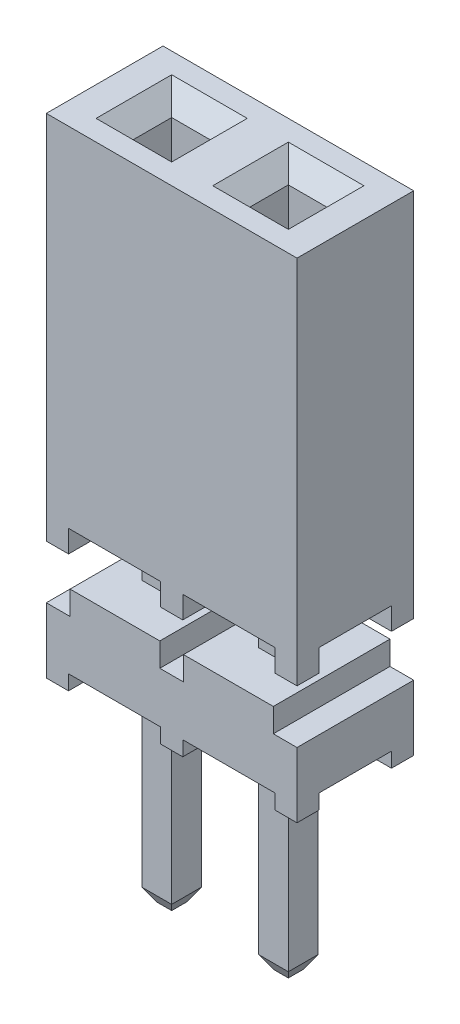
ISO-10303-21;
HEADER;
FILE_DESCRIPTION(('STEP AP214'),'2;1');
FILE_NAME('part.step','',(''),(''),'','','');
FILE_SCHEMA(('AUTOMOTIVE_DESIGN { 1 0 10303 214 1 1 1 1 }'));
ENDSEC;
DATA;
#1=APPLICATION_CONTEXT('core data for automotive mechanical design processes');
#2=APPLICATION_PROTOCOL_DEFINITION('international standard','automotive_design',2000,#1);
#3=PRODUCT_CONTEXT('',#1,'mechanical');
#4=PRODUCT('Part','Part','',(#3));
#5=PRODUCT_RELATED_PRODUCT_CATEGORY('part','',(#4));
#6=PRODUCT_DEFINITION_FORMATION('','',#4);
#7=PRODUCT_DEFINITION_CONTEXT('part definition',#1,'design');
#8=PRODUCT_DEFINITION('design','',#6,#7);
#9=PRODUCT_DEFINITION_SHAPE('','',#8);
#10=(LENGTH_UNIT() NAMED_UNIT(*) SI_UNIT(.MILLI.,.METRE.));
#11=(NAMED_UNIT(*) PLANE_ANGLE_UNIT() SI_UNIT($,.RADIAN.));
#12=(NAMED_UNIT(*) SI_UNIT($,.STERADIAN.) SOLID_ANGLE_UNIT());
#13=UNCERTAINTY_MEASURE_WITH_UNIT(LENGTH_MEASURE(1.E-05),#10,'distance_accuracy_value','');
#14=(GEOMETRIC_REPRESENTATION_CONTEXT(3) GLOBAL_UNCERTAINTY_ASSIGNED_CONTEXT((#13)) GLOBAL_UNIT_ASSIGNED_CONTEXT((#10,
#11,#12)) REPRESENTATION_CONTEXT('',''));
#15=CARTESIAN_POINT('',(0.,0.,0.));
#16=DIRECTION('',(0.,0.,1.));
#17=DIRECTION('',(1.,0.,0.));
#18=AXIS2_PLACEMENT_3D('',#15,#16,#17);
#19=CARTESIAN_POINT('',(0.,-2.159,1.999996));
#20=DIRECTION('',(0.,1.,0.));
#21=DIRECTION('',(0.,0.,1.));
#22=AXIS2_PLACEMENT_3D('',#19,#20,#21);
#23=PLANE('',#22);
#24=DIRECTION('',(0.,0.,-1.));
#25=VECTOR('',#24,1.);
#26=CARTESIAN_POINT('',(1.809496,-2.159,1.999996));
#27=LINE('',#26,#25);
#28=CARTESIAN_POINT('',(1.809496,-2.159,1.999996));
#29=VERTEX_POINT('',#28);
#30=CARTESIAN_POINT('',(1.809496,-2.159,1.618996));
#31=VERTEX_POINT('',#30);
#32=EDGE_CURVE('E765',#29,#31,#27,.T.);
#33=ORIENTED_EDGE('',*,*,#32,.F.);
#34=DIRECTION('',(1.,0.,0.));
#35=VECTOR('',#34,1.);
#36=CARTESIAN_POINT('',(0.,-2.159,1.999996));
#37=LINE('',#36,#35);
#38=CARTESIAN_POINT('',(0.23241,-2.159,1.999996));
#39=VERTEX_POINT('',#38);
#40=EDGE_CURVE('E1068',#39,#29,#37,.T.);
#41=ORIENTED_EDGE('',*,*,#40,.F.);
#42=DIRECTION('',(0.,0.,-1.));
#43=VECTOR('',#42,1.);
#44=CARTESIAN_POINT('',(0.23241,-2.159,1.999996));
#45=LINE('',#44,#43);
#46=CARTESIAN_POINT('',(0.23241,-2.159,1.618996));
#47=VERTEX_POINT('',#46);
#48=EDGE_CURVE('E1006',#39,#47,#45,.T.);
#49=ORIENTED_EDGE('',*,*,#48,.T.);
#50=DIRECTION('',(-1.,0.,0.));
#51=VECTOR('',#50,1.);
#52=CARTESIAN_POINT('',(0.23241,-2.159,1.618996));
#53=LINE('',#52,#51);
#54=CARTESIAN_POINT('',(-0.14859,-2.159,1.618996));
#55=VERTEX_POINT('',#54);
#56=EDGE_CURVE('E995',#47,#55,#53,.T.);
#57=ORIENTED_EDGE('',*,*,#56,.T.);
#58=DIRECTION('',(0.,0.,-1.));
#59=VECTOR('',#58,1.);
#60=CARTESIAN_POINT('',(-0.14859,-2.159,1.618996));
#61=LINE('',#60,#59);
#62=CARTESIAN_POINT('',(-0.14859,-2.159,0.381000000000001));
#63=VERTEX_POINT('',#62);
#64=EDGE_CURVE('E982',#55,#63,#61,.T.);
#65=ORIENTED_EDGE('',*,*,#64,.T.);
#66=DIRECTION('',(-1.,0.,0.));
#67=VECTOR('',#66,1.);
#68=CARTESIAN_POINT('',(0.23241,-2.159,0.381000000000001));
#69=LINE('',#68,#67);
#70=CARTESIAN_POINT('',(0.23241,-2.159,0.381000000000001));
#71=VERTEX_POINT('',#70);
#72=EDGE_CURVE('E993',#71,#63,#69,.T.);
#73=ORIENTED_EDGE('',*,*,#72,.F.);
#74=CARTESIAN_POINT('',(0.23241,-2.159,0.));
#75=VERTEX_POINT('',#74);
#76=EDGE_CURVE('E1003',#71,#75,#45,.T.);
#77=ORIENTED_EDGE('',*,*,#76,.T.);
#78=DIRECTION('',(1.,0.,0.));
#79=VECTOR('',#78,1.);
#80=CARTESIAN_POINT('',(0.,-2.159,0.));
#81=LINE('',#80,#79);
#82=CARTESIAN_POINT('',(1.809496,-2.159,0.));
#83=VERTEX_POINT('',#82);
#84=EDGE_CURVE('E1076',#75,#83,#81,.T.);
#85=ORIENTED_EDGE('',*,*,#84,.T.);
#86=DIRECTION('',(0.,0.,-1.));
#87=VECTOR('',#86,1.);
#88=CARTESIAN_POINT('',(1.809496,-2.159,1.999996));
#89=LINE('',#88,#87);
#90=CARTESIAN_POINT('',(1.809496,-2.159,0.381));
#91=VERTEX_POINT('',#90);
#92=EDGE_CURVE('E1223',#91,#83,#89,.T.);
#93=ORIENTED_EDGE('',*,*,#92,.F.);
#94=DIRECTION('',(-1.,0.,0.));
#95=VECTOR('',#94,1.);
#96=CARTESIAN_POINT('',(0.,-2.159,0.381));
#97=LINE('',#96,#95);
#98=CARTESIAN_POINT('',(2.190496,-2.159,0.381));
#99=VERTEX_POINT('',#98);
#100=EDGE_CURVE('E1220',#99,#91,#97,.T.);
#101=ORIENTED_EDGE('',*,*,#100,.F.);
#102=DIRECTION('',(0.,0.,1.));
#103=VECTOR('',#102,1.);
#104=CARTESIAN_POINT('',(2.190496,-2.159,1.999996));
#105=LINE('',#104,#103);
#106=CARTESIAN_POINT('',(2.190496,-2.159,0.));
#107=VERTEX_POINT('',#106);
#108=EDGE_CURVE('E1217',#107,#99,#105,.T.);
#109=ORIENTED_EDGE('',*,*,#108,.F.);
#110=CARTESIAN_POINT('',(3.767582,-2.159,0.));
#111=VERTEX_POINT('',#110);
#112=EDGE_CURVE('E1075',#107,#111,#81,.T.);
#113=ORIENTED_EDGE('',*,*,#112,.T.);
#114=DIRECTION('',(0.,0.,-1.));
#115=VECTOR('',#114,1.);
#116=CARTESIAN_POINT('',(3.767582,-2.159,1.999996));
#117=LINE('',#116,#115);
#118=CARTESIAN_POINT('',(3.767582,-2.159,0.381000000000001));
#119=VERTEX_POINT('',#118);
#120=EDGE_CURVE('E944',#119,#111,#117,.T.);
#121=ORIENTED_EDGE('',*,*,#120,.F.);
#122=DIRECTION('',(1.,0.,0.));
#123=VECTOR('',#122,1.);
#124=CARTESIAN_POINT('',(3.767582,-2.159,0.381000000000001));
#125=LINE('',#124,#123);
#126=CARTESIAN_POINT('',(4.148582,-2.159,0.381000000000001));
#127=VERTEX_POINT('',#126);
#128=EDGE_CURVE('E949',#119,#127,#125,.T.);
#129=ORIENTED_EDGE('',*,*,#128,.T.);
#130=DIRECTION('',(0.,0.,-1.));
#131=VECTOR('',#130,1.);
#132=CARTESIAN_POINT('',(4.148582,-2.159,1.618996));
#133=LINE('',#132,#131);
#134=CARTESIAN_POINT('',(4.148582,-2.159,1.618996));
#135=VERTEX_POINT('',#134);
#136=EDGE_CURVE('E928',#135,#127,#133,.T.);
#137=ORIENTED_EDGE('',*,*,#136,.F.);
#138=DIRECTION('',(1.,0.,0.));
#139=VECTOR('',#138,1.);
#140=CARTESIAN_POINT('',(3.767582,-2.159,1.618996));
#141=LINE('',#140,#139);
#142=CARTESIAN_POINT('',(3.767582,-2.159,1.618996));
#143=VERTEX_POINT('',#142);
#144=EDGE_CURVE('E951',#143,#135,#141,.T.);
#145=ORIENTED_EDGE('',*,*,#144,.F.);
#146=CARTESIAN_POINT('',(3.767582,-2.159,1.999996));
#147=VERTEX_POINT('',#146);
#148=EDGE_CURVE('E956',#147,#143,#117,.T.);
#149=ORIENTED_EDGE('',*,*,#148,.F.);
#150=CARTESIAN_POINT('',(2.190496,-2.159,1.999996));
#151=VERTEX_POINT('',#150);
#152=EDGE_CURVE('E1066',#151,#147,#37,.T.);
#153=ORIENTED_EDGE('',*,*,#152,.F.);
#154=DIRECTION('',(0.,0.,1.));
#155=VECTOR('',#154,1.);
#156=CARTESIAN_POINT('',(2.190496,-2.159,1.999996));
#157=LINE('',#156,#155);
#158=CARTESIAN_POINT('',(2.190496,-2.159,1.618996));
#159=VERTEX_POINT('',#158);
#160=EDGE_CURVE('E762',#159,#151,#157,.T.);
#161=ORIENTED_EDGE('',*,*,#160,.F.);
#162=DIRECTION('',(1.,0.,0.));
#163=VECTOR('',#162,1.);
#164=CARTESIAN_POINT('',(0.,-2.159,1.618996));
#165=LINE('',#164,#163);
#166=EDGE_CURVE('E1226',#31,#159,#165,.T.);
#167=ORIENTED_EDGE('',*,*,#166,.F.);
#168=EDGE_LOOP('',(#33,#41,#49,#57,#65,#73,#77,#85,#93,#101,#109,#113,#121,#129,#137,#145,#149,
#153,#161,#167));
#169=FACE_BOUND('',#168,.T.);
#170=DIRECTION('',(0.,0.,1.));
#171=VECTOR('',#170,1.);
#172=CARTESIAN_POINT('',(0.745998,-2.159,1.253998));
#173=LINE('',#172,#171);
#174=CARTESIAN_POINT('',(0.745998,-2.159,0.745998));
#175=VERTEX_POINT('',#174);
#176=CARTESIAN_POINT('',(0.745998,-2.159,1.253998));
#177=VERTEX_POINT('',#176);
#178=EDGE_CURVE('E1071',#175,#177,#173,.T.);
#179=ORIENTED_EDGE('',*,*,#178,.T.);
#180=DIRECTION('',(1.,0.,0.));
#181=VECTOR('',#180,1.);
#182=CARTESIAN_POINT('',(0.745998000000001,-2.159,1.253998));
#183=LINE('',#182,#181);
#184=CARTESIAN_POINT('',(1.253998,-2.159,1.253998));
#185=VERTEX_POINT('',#184);
#186=EDGE_CURVE('E1081',#177,#185,#183,.T.);
#187=ORIENTED_EDGE('',*,*,#186,.T.);
#188=DIRECTION('',(0.,0.,-1.));
#189=VECTOR('',#188,1.);
#190=CARTESIAN_POINT('',(1.253998,-2.159,1.253998));
#191=LINE('',#190,#189);
#192=CARTESIAN_POINT('',(1.253998,-2.159,0.745998));
#193=VERTEX_POINT('',#192);
#194=EDGE_CURVE('E1079',#185,#193,#191,.T.);
#195=ORIENTED_EDGE('',*,*,#194,.T.);
#196=DIRECTION('',(1.,0.,0.));
#197=VECTOR('',#196,1.);
#198=CARTESIAN_POINT('',(0.745998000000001,-2.159,0.745998));
#199=LINE('',#198,#197);
#200=EDGE_CURVE('E1201',#175,#193,#199,.T.);
#201=ORIENTED_EDGE('',*,*,#200,.F.);
#202=EDGE_LOOP('',(#179,#187,#195,#201));
#203=FACE_BOUND('',#202,.T.);
#204=DIRECTION('',(-1.,0.,0.));
#205=VECTOR('',#204,1.);
#206=CARTESIAN_POINT('',(0.,-2.159,1.253998));
#207=LINE('',#206,#205);
#208=CARTESIAN_POINT('',(3.253994,-2.159,1.253998));
#209=VERTEX_POINT('',#208);
#210=CARTESIAN_POINT('',(2.745994,-2.159,1.253998));
#211=VERTEX_POINT('',#210);
#212=EDGE_CURVE('E620',#209,#211,#207,.T.);
#213=ORIENTED_EDGE('',*,*,#212,.F.);
#214=DIRECTION('',(0.,0.,1.));
#215=VECTOR('',#214,1.);
#216=CARTESIAN_POINT('',(3.253994,-2.159,1.999996));
#217=LINE('',#216,#215);
#218=CARTESIAN_POINT('',(3.253994,-2.159,0.745998));
#219=VERTEX_POINT('',#218);
#220=EDGE_CURVE('E628',#219,#209,#217,.T.);
#221=ORIENTED_EDGE('',*,*,#220,.F.);
#222=DIRECTION('',(-1.,0.,0.));
#223=VECTOR('',#222,1.);
#224=CARTESIAN_POINT('',(0.,-2.159,0.745998));
#225=LINE('',#224,#223);
#226=CARTESIAN_POINT('',(2.745994,-2.159,0.745998));
#227=VERTEX_POINT('',#226);
#228=EDGE_CURVE('E615',#219,#227,#225,.T.);
#229=ORIENTED_EDGE('',*,*,#228,.T.);
#230=DIRECTION('',(0.,0.,-1.));
#231=VECTOR('',#230,1.);
#232=CARTESIAN_POINT('',(2.745994,-2.159,1.999996));
#233=LINE('',#232,#231);
#234=EDGE_CURVE('E624',#211,#227,#233,.T.);
#235=ORIENTED_EDGE('',*,*,#234,.F.);
#236=EDGE_LOOP('',(#213,#221,#229,#235));
#237=FACE_BOUND('',#236,.T.);
#238=ADVANCED_FACE('F33',(#169,#203,#237),#23,.F.);
#239=CARTESIAN_POINT('',(0.,-0.889000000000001,1.999996));
#240=DIRECTION('',(0.,-1.,0.));
#241=DIRECTION('',(0.,0.,-1.));
#242=AXIS2_PLACEMENT_3D('',#239,#240,#241);
#243=PLANE('',#242);
#244=DIRECTION('',(0.,0.,-1.));
#245=VECTOR('',#244,1.);
#246=CARTESIAN_POINT('',(2.203196,-0.889000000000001,1.999996));
#247=LINE('',#246,#245);
#248=CARTESIAN_POINT('',(2.203196,-0.889000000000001,1.999996));
#249=VERTEX_POINT('',#248);
#250=CARTESIAN_POINT('',(2.203196,-0.889000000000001,0.));
#251=VERTEX_POINT('',#250);
#252=EDGE_CURVE('E860',#249,#251,#247,.T.);
#253=ORIENTED_EDGE('',*,*,#252,.F.);
#254=DIRECTION('',(-1.,0.,0.));
#255=VECTOR('',#254,1.);
#256=CARTESIAN_POINT('',(0.,-0.889000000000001,1.999996));
#257=LINE('',#256,#255);
#258=CARTESIAN_POINT('',(3.742182,-0.889,1.999996));
#259=VERTEX_POINT('',#258);
#260=EDGE_CURVE('E1063',#259,#249,#257,.T.);
#261=ORIENTED_EDGE('',*,*,#260,.F.);
#262=DIRECTION('',(0.,0.,-1.));
#263=VECTOR('',#262,1.);
#264=CARTESIAN_POINT('',(3.742182,-0.889,1.999996));
#265=LINE('',#264,#263);
#266=CARTESIAN_POINT('',(3.742182,-0.889,0.));
#267=VERTEX_POINT('',#266);
#268=EDGE_CURVE('E881',#259,#267,#265,.T.);
#269=ORIENTED_EDGE('',*,*,#268,.T.);
#270=DIRECTION('',(-1.,0.,0.));
#271=VECTOR('',#270,1.);
#272=CARTESIAN_POINT('',(0.,-0.889000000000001,0.));
#273=LINE('',#272,#271);
#274=EDGE_CURVE('E1072',#267,#251,#273,.T.);
#275=ORIENTED_EDGE('',*,*,#274,.T.);
#276=EDGE_LOOP('',(#253,#261,#269,#275));
#277=FACE_BOUND('',#276,.T.);
#278=DIRECTION('',(1.,0.,0.));
#279=VECTOR('',#278,1.);
#280=CARTESIAN_POINT('',(0.,-0.889000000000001,1.253998));
#281=LINE('',#280,#279);
#282=CARTESIAN_POINT('',(2.745994,-0.889000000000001,1.253998));
#283=VERTEX_POINT('',#282);
#284=CARTESIAN_POINT('',(3.253994,-0.889000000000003,1.253998));
#285=VERTEX_POINT('',#284);
#286=EDGE_CURVE('E618',#283,#285,#281,.T.);
#287=ORIENTED_EDGE('',*,*,#286,.F.);
#288=DIRECTION('',(0.,0.,1.));
#289=VECTOR('',#288,1.);
#290=CARTESIAN_POINT('',(2.745994,-0.889000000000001,1.999996));
#291=LINE('',#290,#289);
#292=CARTESIAN_POINT('',(2.745994,-0.889000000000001,0.745998));
#293=VERTEX_POINT('',#292);
#294=EDGE_CURVE('E622',#293,#283,#291,.T.);
#295=ORIENTED_EDGE('',*,*,#294,.F.);
#296=DIRECTION('',(1.,0.,0.));
#297=VECTOR('',#296,1.);
#298=CARTESIAN_POINT('',(0.,-0.889000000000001,0.745998));
#299=LINE('',#298,#297);
#300=CARTESIAN_POINT('',(3.253994,-0.889000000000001,0.745998));
#301=VERTEX_POINT('',#300);
#302=EDGE_CURVE('E589',#293,#301,#299,.T.);
#303=ORIENTED_EDGE('',*,*,#302,.T.);
#304=DIRECTION('',(0.,0.,-1.));
#305=VECTOR('',#304,1.);
#306=CARTESIAN_POINT('',(3.253994,-0.889000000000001,1.999996));
#307=LINE('',#306,#305);
#308=EDGE_CURVE('E596',#285,#301,#307,.T.);
#309=ORIENTED_EDGE('',*,*,#308,.F.);
#310=EDGE_LOOP('',(#287,#295,#303,#309));
#311=FACE_BOUND('',#310,.T.);
#312=ADVANCED_FACE('F1286',(#277,#311),#243,.F.);
#313=CARTESIAN_POINT('',(1.999996,0.,0.));
#314=DIRECTION('',(0.,-1.,0.));
#315=DIRECTION('',(0.,0.,-1.));
#316=AXIS2_PLACEMENT_3D('',#313,#314,#315);
#317=PLANE('',#316);
#318=DIRECTION('',(0.,0.,-1.));
#319=VECTOR('',#318,1.);
#320=CARTESIAN_POINT('',(0.745998,0.,1.253998));
#321=LINE('',#320,#319);
#322=CARTESIAN_POINT('',(0.745998,0.,1.253998));
#323=VERTEX_POINT('',#322);
#324=CARTESIAN_POINT('',(0.745998,0.,0.745998));
#325=VERTEX_POINT('',#324);
#326=EDGE_CURVE('E1101',#323,#325,#321,.T.);
#327=ORIENTED_EDGE('',*,*,#326,.F.);
#328=DIRECTION('',(-1.,0.,0.));
#329=VECTOR('',#328,1.);
#330=CARTESIAN_POINT('',(0.745998,0.,1.253998));
#331=LINE('',#330,#329);
#332=CARTESIAN_POINT('',(1.253998,0.,1.253998));
#333=VERTEX_POINT('',#332);
#334=EDGE_CURVE('E1093',#333,#323,#331,.T.);
#335=ORIENTED_EDGE('',*,*,#334,.F.);
#336=DIRECTION('',(0.,0.,-1.));
#337=VECTOR('',#336,1.);
#338=CARTESIAN_POINT('',(1.253998,0.,1.253998));
#339=LINE('',#338,#337);
#340=CARTESIAN_POINT('',(1.253998,0.,0.745998));
#341=VERTEX_POINT('',#340);
#342=EDGE_CURVE('E1114',#333,#341,#339,.T.);
#343=ORIENTED_EDGE('',*,*,#342,.T.);
#344=DIRECTION('',(-1.,0.,0.));
#345=VECTOR('',#344,1.);
#346=CARTESIAN_POINT('',(0.745998,0.,0.745998));
#347=LINE('',#346,#345);
#348=EDGE_CURVE('E1105',#341,#325,#347,.T.);
#349=ORIENTED_EDGE('',*,*,#348,.T.);
#350=EDGE_LOOP('',(#327,#335,#343,#349));
#351=FACE_BOUND('',#350,.T.);
#352=DIRECTION('',(0.,0.,-1.));
#353=VECTOR('',#352,1.);
#354=CARTESIAN_POINT('',(3.767582,0.,0.));
#355=LINE('',#354,#353);
#356=CARTESIAN_POINT('',(3.767582,0.,1.999996));
#357=VERTEX_POINT('',#356);
#358=CARTESIAN_POINT('',(3.767582,0.,1.618996));
#359=VERTEX_POINT('',#358);
#360=EDGE_CURVE('E687',#357,#359,#355,.T.);
#361=ORIENTED_EDGE('',*,*,#360,.F.);
#362=DIRECTION('',(1.,0.,0.));
#363=VECTOR('',#362,1.);
#364=CARTESIAN_POINT('',(0.,0.,1.999996));
#365=LINE('',#364,#363);
#366=CARTESIAN_POINT('',(2.190496,0.,1.999996));
#367=VERTEX_POINT('',#366);
#368=EDGE_CURVE('E1176',#367,#357,#365,.T.);
#369=ORIENTED_EDGE('',*,*,#368,.F.);
#370=DIRECTION('',(0.,0.,-1.));
#371=VECTOR('',#370,1.);
#372=CARTESIAN_POINT('',(2.190496,0.,1.618996));
#373=LINE('',#372,#371);
#374=CARTESIAN_POINT('',(2.190496,0.,1.618996));
#375=VERTEX_POINT('',#374);
#376=EDGE_CURVE('E779',#367,#375,#373,.T.);
#377=ORIENTED_EDGE('',*,*,#376,.T.);
#378=DIRECTION('',(-1.,0.,0.));
#379=VECTOR('',#378,1.);
#380=CARTESIAN_POINT('',(1.809496,0.,1.618996));
#381=LINE('',#380,#379);
#382=CARTESIAN_POINT('',(1.809496,0.,1.618996));
#383=VERTEX_POINT('',#382);
#384=EDGE_CURVE('E782',#375,#383,#381,.T.);
#385=ORIENTED_EDGE('',*,*,#384,.T.);
#386=DIRECTION('',(0.,0.,1.));
#387=VECTOR('',#386,1.);
#388=CARTESIAN_POINT('',(1.809496,0.,1.618996));
#389=LINE('',#388,#387);
#390=CARTESIAN_POINT('',(1.809496,0.,1.999996));
#391=VERTEX_POINT('',#390);
#392=EDGE_CURVE('E768',#383,#391,#389,.T.);
#393=ORIENTED_EDGE('',*,*,#392,.T.);
#394=CARTESIAN_POINT('',(0.23241,0.,1.999996));
#395=VERTEX_POINT('',#394);
#396=EDGE_CURVE('E1173',#395,#391,#365,.T.);
#397=ORIENTED_EDGE('',*,*,#396,.F.);
#398=DIRECTION('',(0.,0.,1.));
#399=VECTOR('',#398,1.);
#400=CARTESIAN_POINT('',(0.23241,0.,0.));
#401=LINE('',#400,#399);
#402=CARTESIAN_POINT('',(0.23241,0.,1.618996));
#403=VERTEX_POINT('',#402);
#404=EDGE_CURVE('E738',#403,#395,#401,.T.);
#405=ORIENTED_EDGE('',*,*,#404,.F.);
#406=DIRECTION('',(-1.,0.,0.));
#407=VECTOR('',#406,1.);
#408=CARTESIAN_POINT('',(0.23241,0.,1.618996));
#409=LINE('',#408,#407);
#410=CARTESIAN_POINT('',(-0.14859,0.,1.618996));
#411=VERTEX_POINT('',#410);
#412=EDGE_CURVE('E730',#403,#411,#409,.T.);
#413=ORIENTED_EDGE('',*,*,#412,.T.);
#414=DIRECTION('',(0.,0.,-1.));
#415=VECTOR('',#414,1.);
#416=CARTESIAN_POINT('',(-0.14859,0.,1.618996));
#417=LINE('',#416,#415);
#418=CARTESIAN_POINT('',(-0.14859,0.,0.381));
#419=VERTEX_POINT('',#418);
#420=EDGE_CURVE('E714',#411,#419,#417,.T.);
#421=ORIENTED_EDGE('',*,*,#420,.T.);
#422=DIRECTION('',(-1.,0.,0.));
#423=VECTOR('',#422,1.);
#424=CARTESIAN_POINT('',(0.23241,0.,0.381));
#425=LINE('',#424,#423);
#426=CARTESIAN_POINT('',(0.23241,0.,0.381));
#427=VERTEX_POINT('',#426);
#428=EDGE_CURVE('E728',#427,#419,#425,.T.);
#429=ORIENTED_EDGE('',*,*,#428,.F.);
#430=CARTESIAN_POINT('',(0.23241,0.,0.));
#431=VERTEX_POINT('',#430);
#432=EDGE_CURVE('E741',#431,#427,#401,.T.);
#433=ORIENTED_EDGE('',*,*,#432,.F.);
#434=DIRECTION('',(-1.,0.,0.));
#435=VECTOR('',#434,1.);
#436=CARTESIAN_POINT('',(0.,0.,0.));
#437=LINE('',#436,#435);
#438=CARTESIAN_POINT('',(1.809496,0.,0.));
#439=VERTEX_POINT('',#438);
#440=EDGE_CURVE('E1164',#439,#431,#437,.T.);
#441=ORIENTED_EDGE('',*,*,#440,.F.);
#442=DIRECTION('',(0.,0.,1.));
#443=VECTOR('',#442,1.);
#444=CARTESIAN_POINT('',(1.809496,0.,0.));
#445=LINE('',#444,#443);
#446=CARTESIAN_POINT('',(1.809496,0.,0.381));
#447=VERTEX_POINT('',#446);
#448=EDGE_CURVE('E815',#439,#447,#445,.T.);
#449=ORIENTED_EDGE('',*,*,#448,.T.);
#450=DIRECTION('',(1.,0.,0.));
#451=VECTOR('',#450,1.);
#452=CARTESIAN_POINT('',(1.809496,0.,0.381));
#453=LINE('',#452,#451);
#454=CARTESIAN_POINT('',(2.190496,0.,0.381));
#455=VERTEX_POINT('',#454);
#456=EDGE_CURVE('E826',#447,#455,#453,.T.);
#457=ORIENTED_EDGE('',*,*,#456,.T.);
#458=DIRECTION('',(0.,0.,-1.));
#459=VECTOR('',#458,1.);
#460=CARTESIAN_POINT('',(2.190496,0.,0.));
#461=LINE('',#460,#459);
#462=CARTESIAN_POINT('',(2.190496,0.,0.));
#463=VERTEX_POINT('',#462);
#464=EDGE_CURVE('E829',#455,#463,#461,.T.);
#465=ORIENTED_EDGE('',*,*,#464,.T.);
#466=CARTESIAN_POINT('',(3.767582,0.,0.));
#467=VERTEX_POINT('',#466);
#468=EDGE_CURVE('E1177',#467,#463,#437,.T.);
#469=ORIENTED_EDGE('',*,*,#468,.F.);
#470=CARTESIAN_POINT('',(3.767582,0.,0.381));
#471=VERTEX_POINT('',#470);
#472=EDGE_CURVE('E675',#471,#467,#355,.T.);
#473=ORIENTED_EDGE('',*,*,#472,.F.);
#474=DIRECTION('',(1.,0.,0.));
#475=VECTOR('',#474,1.);
#476=CARTESIAN_POINT('',(3.767582,0.,0.381));
#477=LINE('',#476,#475);
#478=CARTESIAN_POINT('',(4.148582,0.,0.381));
#479=VERTEX_POINT('',#478);
#480=EDGE_CURVE('E678',#471,#479,#477,.T.);
#481=ORIENTED_EDGE('',*,*,#480,.T.);
#482=DIRECTION('',(0.,0.,-1.));
#483=VECTOR('',#482,1.);
#484=CARTESIAN_POINT('',(4.148582,0.,1.618996));
#485=LINE('',#484,#483);
#486=CARTESIAN_POINT('',(4.148582,0.,1.618996));
#487=VERTEX_POINT('',#486);
#488=EDGE_CURVE('E662',#487,#479,#485,.T.);
#489=ORIENTED_EDGE('',*,*,#488,.F.);
#490=DIRECTION('',(1.,0.,0.));
#491=VECTOR('',#490,1.);
#492=CARTESIAN_POINT('',(3.767582,0.,1.618996));
#493=LINE('',#492,#491);
#494=EDGE_CURVE('E680',#359,#487,#493,.T.);
#495=ORIENTED_EDGE('',*,*,#494,.F.);
#496=EDGE_LOOP('',(#361,#369,#377,#385,#393,#397,#405,#413,#421,#429,#433,#441,#449,#457,#465,
#469,#473,#481,#489,#495));
#497=FACE_BOUND('',#496,.T.);
#498=DIRECTION('',(0.,0.,-1.));
#499=VECTOR('',#498,1.);
#500=CARTESIAN_POINT('',(2.745994,0.,1.253998));
#501=LINE('',#500,#499);
#502=CARTESIAN_POINT('',(2.745994,0.,1.253998));
#503=VERTEX_POINT('',#502);
#504=CARTESIAN_POINT('',(2.745994,0.,0.745998));
#505=VERTEX_POINT('',#504);
#506=EDGE_CURVE('E590',#503,#505,#501,.T.);
#507=ORIENTED_EDGE('',*,*,#506,.F.);
#508=DIRECTION('',(-1.,0.,0.));
#509=VECTOR('',#508,1.);
#510=CARTESIAN_POINT('',(2.745994,0.,1.253998));
#511=LINE('',#510,#509);
#512=CARTESIAN_POINT('',(3.253994,0.,1.253998));
#513=VERTEX_POINT('',#512);
#514=EDGE_CURVE('E585',#513,#503,#511,.T.);
#515=ORIENTED_EDGE('',*,*,#514,.F.);
#516=DIRECTION('',(0.,0.,-1.));
#517=VECTOR('',#516,1.);
#518=CARTESIAN_POINT('',(3.253994,0.,1.253998));
#519=LINE('',#518,#517);
#520=CARTESIAN_POINT('',(3.253994,0.,0.745998));
#521=VERTEX_POINT('',#520);
#522=EDGE_CURVE('E578',#513,#521,#519,.T.);
#523=ORIENTED_EDGE('',*,*,#522,.T.);
#524=DIRECTION('',(-1.,0.,0.));
#525=VECTOR('',#524,1.);
#526=CARTESIAN_POINT('',(2.745994,0.,0.745998));
#527=LINE('',#526,#525);
#528=EDGE_CURVE('E582',#521,#505,#527,.T.);
#529=ORIENTED_EDGE('',*,*,#528,.T.);
#530=EDGE_LOOP('',(#507,#515,#523,#529));
#531=FACE_BOUND('',#530,.T.);
#532=ADVANCED_FACE('F580',(#351,#497,#531),#317,.T.);
#533=DIRECTION('',(0.,0.,1.));
#534=VECTOR('',#533,1.);
#535=CARTESIAN_POINT('',(1.253998,-0.889000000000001,1.253998));
#536=LINE('',#535,#534);
#537=CARTESIAN_POINT('',(1.253998,-0.889000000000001,0.745998));
#538=VERTEX_POINT('',#537);
#539=CARTESIAN_POINT('',(1.253998,-0.889000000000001,1.253998));
#540=VERTEX_POINT('',#539);
#541=EDGE_CURVE('E1085',#538,#540,#536,.T.);
#542=ORIENTED_EDGE('',*,*,#541,.T.);
#543=DIRECTION('',(-1.,0.,0.));
#544=VECTOR('',#543,1.);
#545=CARTESIAN_POINT('',(0.745998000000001,-0.889000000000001,1.253998));
#546=LINE('',#545,#544);
#547=CARTESIAN_POINT('',(0.745998,-0.889000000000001,1.253998));
#548=VERTEX_POINT('',#547);
#549=EDGE_CURVE('E1087',#540,#548,#546,.T.);
#550=ORIENTED_EDGE('',*,*,#549,.T.);
#551=DIRECTION('',(0.,0.,-1.));
#552=VECTOR('',#551,1.);
#553=CARTESIAN_POINT('',(0.745998,-0.889000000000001,1.253998));
#554=LINE('',#553,#552);
#555=CARTESIAN_POINT('',(0.745998,-0.889000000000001,0.745998));
#556=VERTEX_POINT('',#555);
#557=EDGE_CURVE('E1083',#548,#556,#554,.T.);
#558=ORIENTED_EDGE('',*,*,#557,.T.);
#559=DIRECTION('',(-1.,0.,0.));
#560=VECTOR('',#559,1.);
#561=CARTESIAN_POINT('',(0.745998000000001,-0.889000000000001,0.745998));
#562=LINE('',#561,#560);
#563=EDGE_CURVE('E1214',#538,#556,#562,.T.);
#564=ORIENTED_EDGE('',*,*,#563,.F.);
#565=EDGE_LOOP('',(#542,#550,#558,#564));
#566=FACE_BOUND('',#565,.T.);
#567=DIRECTION('',(0.,0.,-1.));
#568=VECTOR('',#567,1.);
#569=CARTESIAN_POINT('',(1.796796,-0.889000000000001,1.999996));
#570=LINE('',#569,#568);
#571=CARTESIAN_POINT('',(1.796796,-0.889000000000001,1.999996));
#572=VERTEX_POINT('',#571);
#573=CARTESIAN_POINT('',(1.796796,-0.889000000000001,0.));
#574=VERTEX_POINT('',#573);
#575=EDGE_CURVE('E850',#572,#574,#570,.T.);
#576=ORIENTED_EDGE('',*,*,#575,.T.);
#577=CARTESIAN_POINT('',(0.25781,-0.889000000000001,0.));
#578=VERTEX_POINT('',#577);
#579=EDGE_CURVE('E1054',#574,#578,#273,.T.);
#580=ORIENTED_EDGE('',*,*,#579,.T.);
#581=DIRECTION('',(0.,0.,-1.));
#582=VECTOR('',#581,1.);
#583=CARTESIAN_POINT('',(0.25781,-0.889000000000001,1.999996));
#584=LINE('',#583,#582);
#585=CARTESIAN_POINT('',(0.25781,-0.889000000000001,1.999996));
#586=VERTEX_POINT('',#585);
#587=EDGE_CURVE('E900',#586,#578,#584,.T.);
#588=ORIENTED_EDGE('',*,*,#587,.F.);
#589=EDGE_CURVE('E1067',#572,#586,#257,.T.);
#590=ORIENTED_EDGE('',*,*,#589,.F.);
#591=EDGE_LOOP('',(#576,#580,#588,#590));
#592=FACE_BOUND('',#591,.T.);
#593=ADVANCED_FACE('F1294',(#566,#592),#243,.F.);
#594=CARTESIAN_POINT('',(1.999996,-2.159,1.999996));
#595=DIRECTION('',(0.,0.,1.));
#596=DIRECTION('',(1.,0.,0.));
#597=AXIS2_PLACEMENT_3D('',#594,#595,#596);
#598=PLANE('',#597);
#599=ORIENTED_EDGE('',*,*,#40,.T.);
#600=DIRECTION('',(0.,-1.,0.));
#601=VECTOR('',#600,1.);
#602=CARTESIAN_POINT('',(1.809496,-2.032,1.999996));
#603=LINE('',#602,#601);
#604=CARTESIAN_POINT('',(1.809496,-2.413,1.999996));
#605=VERTEX_POINT('',#604);
#606=EDGE_CURVE('E760',#29,#605,#603,.T.);
#607=ORIENTED_EDGE('',*,*,#606,.T.);
#608=DIRECTION('',(1.,0.,0.));
#609=VECTOR('',#608,1.);
#610=CARTESIAN_POINT('',(1.809496,-2.413,1.999996));
#611=LINE('',#610,#609);
#612=CARTESIAN_POINT('',(2.190496,-2.413,1.999996));
#613=VERTEX_POINT('',#612);
#614=EDGE_CURVE('E745',#605,#613,#611,.T.);
#615=ORIENTED_EDGE('',*,*,#614,.T.);
#616=DIRECTION('',(0.,-1.,0.));
#617=VECTOR('',#616,1.);
#618=CARTESIAN_POINT('',(2.190496,-2.032,1.999996));
#619=LINE('',#618,#617);
#620=EDGE_CURVE('E758',#151,#613,#619,.T.);
#621=ORIENTED_EDGE('',*,*,#620,.F.);
#622=ORIENTED_EDGE('',*,*,#152,.T.);
#623=DIRECTION('',(0.,-1.,0.));
#624=VECTOR('',#623,1.);
#625=CARTESIAN_POINT('',(3.767582,-0.889000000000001,1.999996));
#626=LINE('',#625,#624);
#627=CARTESIAN_POINT('',(3.767582,-2.413,1.999996));
#628=VERTEX_POINT('',#627);
#629=EDGE_CURVE('E920',#147,#628,#626,.T.);
#630=ORIENTED_EDGE('',*,*,#629,.T.);
#631=DIRECTION('',(1.,0.,0.));
#632=VECTOR('',#631,1.);
#633=CARTESIAN_POINT('',(3.767582,-2.413,1.999996));
#634=LINE('',#633,#632);
#635=CARTESIAN_POINT('',(4.148582,-2.413,1.999996));
#636=VERTEX_POINT('',#635);
#637=EDGE_CURVE('E941',#628,#636,#634,.T.);
#638=ORIENTED_EDGE('',*,*,#637,.T.);
#639=DIRECTION('',(0.,-1.,0.));
#640=VECTOR('',#639,1.);
#641=CARTESIAN_POINT('',(4.148582,-0.889000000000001,1.999996));
#642=LINE('',#641,#640);
#643=CARTESIAN_POINT('',(4.148582,-1.2954,1.999996));
#644=VERTEX_POINT('',#643);
#645=EDGE_CURVE('E908',#644,#636,#642,.T.);
#646=ORIENTED_EDGE('',*,*,#645,.F.);
#647=DIRECTION('',(1.,0.,0.));
#648=VECTOR('',#647,1.);
#649=CARTESIAN_POINT('',(4.148582,-1.2954,1.999996));
#650=LINE('',#649,#648);
#651=CARTESIAN_POINT('',(3.742182,-1.2954,1.999996));
#652=VERTEX_POINT('',#651);
#653=EDGE_CURVE('E870',#652,#644,#650,.T.);
#654=ORIENTED_EDGE('',*,*,#653,.F.);
#655=DIRECTION('',(0.,-1.,0.));
#656=VECTOR('',#655,1.);
#657=CARTESIAN_POINT('',(3.742182,-0.889,1.999996));
#658=LINE('',#657,#656);
#659=EDGE_CURVE('E868',#259,#652,#658,.T.);
#660=ORIENTED_EDGE('',*,*,#659,.F.);
#661=ORIENTED_EDGE('',*,*,#260,.T.);
#662=DIRECTION('',(0.,1.,0.));
#663=VECTOR('',#662,1.);
#664=CARTESIAN_POINT('',(2.203196,-0.889000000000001,1.999996));
#665=LINE('',#664,#663);
#666=CARTESIAN_POINT('',(2.203196,-1.2954,1.999996));
#667=VERTEX_POINT('',#666);
#668=EDGE_CURVE('E848',#667,#249,#665,.T.);
#669=ORIENTED_EDGE('',*,*,#668,.F.);
#670=DIRECTION('',(1.,0.,0.));
#671=VECTOR('',#670,1.);
#672=CARTESIAN_POINT('',(1.796796,-1.2954,1.999996));
#673=LINE('',#672,#671);
#674=CARTESIAN_POINT('',(1.796796,-1.2954,1.999996));
#675=VERTEX_POINT('',#674);
#676=EDGE_CURVE('E845',#675,#667,#673,.T.);
#677=ORIENTED_EDGE('',*,*,#676,.F.);
#678=DIRECTION('',(0.,-1.,0.));
#679=VECTOR('',#678,1.);
#680=CARTESIAN_POINT('',(1.796796,-0.889000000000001,1.999996));
#681=LINE('',#680,#679);
#682=EDGE_CURVE('E843',#572,#675,#681,.T.);
#683=ORIENTED_EDGE('',*,*,#682,.F.);
#684=ORIENTED_EDGE('',*,*,#589,.T.);
#685=DIRECTION('',(0.,1.,0.));
#686=VECTOR('',#685,1.);
#687=CARTESIAN_POINT('',(0.25781,-0.889000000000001,1.999996));
#688=LINE('',#687,#686);
#689=CARTESIAN_POINT('',(0.25781,-1.2954,1.999996));
#690=VERTEX_POINT('',#689);
#691=EDGE_CURVE('E885',#690,#586,#688,.T.);
#692=ORIENTED_EDGE('',*,*,#691,.F.);
#693=DIRECTION('',(1.,0.,0.));
#694=VECTOR('',#693,1.);
#695=CARTESIAN_POINT('',(0.25781,-1.2954,1.999996));
#696=LINE('',#695,#694);
#697=CARTESIAN_POINT('',(-0.14859,-1.2954,1.999996));
#698=VERTEX_POINT('',#697);
#699=EDGE_CURVE('E888',#698,#690,#696,.T.);
#700=ORIENTED_EDGE('',*,*,#699,.F.);
#701=DIRECTION('',(0.,-1.,0.));
#702=VECTOR('',#701,1.);
#703=CARTESIAN_POINT('',(-0.14859,-0.889000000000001,1.999996));
#704=LINE('',#703,#702);
#705=CARTESIAN_POINT('',(-0.14859,-2.413,1.999996));
#706=VERTEX_POINT('',#705);
#707=EDGE_CURVE('E975',#698,#706,#704,.T.);
#708=ORIENTED_EDGE('',*,*,#707,.T.);
#709=DIRECTION('',(-1.,0.,0.));
#710=VECTOR('',#709,1.);
#711=CARTESIAN_POINT('',(0.23241,-2.413,1.999996));
#712=LINE('',#711,#710);
#713=CARTESIAN_POINT('',(0.23241,-2.413,1.999996));
#714=VERTEX_POINT('',#713);
#715=EDGE_CURVE('E1000',#714,#706,#712,.T.);
#716=ORIENTED_EDGE('',*,*,#715,.F.);
#717=DIRECTION('',(0.,-1.,0.));
#718=VECTOR('',#717,1.);
#719=CARTESIAN_POINT('',(0.23241,-0.889000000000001,1.999996));
#720=LINE('',#719,#718);
#721=EDGE_CURVE('E959',#39,#714,#720,.T.);
#722=ORIENTED_EDGE('',*,*,#721,.F.);
#723=EDGE_LOOP('',(#599,#607,#615,#621,#622,#630,#638,#646,#654,#660,#661,#669,#677,#683,#684,
#692,#700,#708,#716,#722));
#724=FACE_BOUND('',#723,.T.);
#725=ADVANCED_FACE('F1301',(#724),#598,.T.);
#726=CARTESIAN_POINT('',(1.999996,-2.159,0.));
#727=DIRECTION('',(0.,0.,1.));
#728=DIRECTION('',(1.,0.,0.));
#729=AXIS2_PLACEMENT_3D('',#726,#727,#728);
#730=PLANE('',#729);
#731=ORIENTED_EDGE('',*,*,#112,.F.);
#732=DIRECTION('',(0.,-1.,0.));
#733=VECTOR('',#732,1.);
#734=CARTESIAN_POINT('',(2.190496,-2.032,0.));
#735=LINE('',#734,#733);
#736=CARTESIAN_POINT('',(2.190496,-2.413,0.));
#737=VERTEX_POINT('',#736);
#738=EDGE_CURVE('E809',#107,#737,#735,.T.);
#739=ORIENTED_EDGE('',*,*,#738,.T.);
#740=DIRECTION('',(-1.,0.,0.));
#741=VECTOR('',#740,1.);
#742=CARTESIAN_POINT('',(2.190496,-2.413,0.));
#743=LINE('',#742,#741);
#744=CARTESIAN_POINT('',(1.809496,-2.413,0.));
#745=VERTEX_POINT('',#744);
#746=EDGE_CURVE('E804',#737,#745,#743,.T.);
#747=ORIENTED_EDGE('',*,*,#746,.T.);
#748=DIRECTION('',(0.,-1.,0.));
#749=VECTOR('',#748,1.);
#750=CARTESIAN_POINT('',(1.809496,-2.032,0.));
#751=LINE('',#750,#749);
#752=EDGE_CURVE('E807',#83,#745,#751,.T.);
#753=ORIENTED_EDGE('',*,*,#752,.F.);
#754=ORIENTED_EDGE('',*,*,#84,.F.);
#755=DIRECTION('',(0.,1.,0.));
#756=VECTOR('',#755,1.);
#757=CARTESIAN_POINT('',(0.23241,-2.413,0.));
#758=LINE('',#757,#756);
#759=CARTESIAN_POINT('',(0.23241,-2.413,0.));
#760=VERTEX_POINT('',#759);
#761=EDGE_CURVE('E957',#760,#75,#758,.T.);
#762=ORIENTED_EDGE('',*,*,#761,.F.);
#763=DIRECTION('',(-1.,0.,0.));
#764=VECTOR('',#763,1.);
#765=CARTESIAN_POINT('',(0.23241,-2.413,0.));
#766=LINE('',#765,#764);
#767=CARTESIAN_POINT('',(-0.14859,-2.413,0.));
#768=VERTEX_POINT('',#767);
#769=EDGE_CURVE('E971',#760,#768,#766,.T.);
#770=ORIENTED_EDGE('',*,*,#769,.T.);
#771=DIRECTION('',(0.,1.,0.));
#772=VECTOR('',#771,1.);
#773=CARTESIAN_POINT('',(-0.14859,-2.413,0.));
#774=LINE('',#773,#772);
#775=CARTESIAN_POINT('',(-0.14859,-1.2954,0.));
#776=VERTEX_POINT('',#775);
#777=EDGE_CURVE('E972',#768,#776,#774,.T.);
#778=ORIENTED_EDGE('',*,*,#777,.T.);
#779=DIRECTION('',(1.,0.,0.));
#780=VECTOR('',#779,1.);
#781=CARTESIAN_POINT('',(0.25781,-1.2954,0.));
#782=LINE('',#781,#780);
#783=CARTESIAN_POINT('',(0.25781,-1.2954,0.));
#784=VERTEX_POINT('',#783);
#785=EDGE_CURVE('E889',#776,#784,#782,.T.);
#786=ORIENTED_EDGE('',*,*,#785,.T.);
#787=DIRECTION('',(0.,1.,0.));
#788=VECTOR('',#787,1.);
#789=CARTESIAN_POINT('',(0.25781,-0.889000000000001,0.));
#790=LINE('',#789,#788);
#791=EDGE_CURVE('E884',#784,#578,#790,.T.);
#792=ORIENTED_EDGE('',*,*,#791,.T.);
#793=ORIENTED_EDGE('',*,*,#579,.F.);
#794=DIRECTION('',(0.,-1.,0.));
#795=VECTOR('',#794,1.);
#796=CARTESIAN_POINT('',(1.796796,-0.889000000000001,0.));
#797=LINE('',#796,#795);
#798=CARTESIAN_POINT('',(1.796796,-1.2954,0.));
#799=VERTEX_POINT('',#798);
#800=EDGE_CURVE('E842',#574,#799,#797,.T.);
#801=ORIENTED_EDGE('',*,*,#800,.T.);
#802=DIRECTION('',(1.,0.,0.));
#803=VECTOR('',#802,1.);
#804=CARTESIAN_POINT('',(1.796796,-1.2954,0.));
#805=LINE('',#804,#803);
#806=CARTESIAN_POINT('',(2.203196,-1.2954,0.));
#807=VERTEX_POINT('',#806);
#808=EDGE_CURVE('E853',#799,#807,#805,.T.);
#809=ORIENTED_EDGE('',*,*,#808,.T.);
#810=DIRECTION('',(0.,1.,0.));
#811=VECTOR('',#810,1.);
#812=CARTESIAN_POINT('',(2.203196,-0.889000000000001,0.));
#813=LINE('',#812,#811);
#814=EDGE_CURVE('E846',#807,#251,#813,.T.);
#815=ORIENTED_EDGE('',*,*,#814,.T.);
#816=ORIENTED_EDGE('',*,*,#274,.F.);
#817=DIRECTION('',(0.,-1.,0.));
#818=VECTOR('',#817,1.);
#819=CARTESIAN_POINT('',(3.742182,-0.889,0.));
#820=LINE('',#819,#818);
#821=CARTESIAN_POINT('',(3.742182,-1.2954,0.));
#822=VERTEX_POINT('',#821);
#823=EDGE_CURVE('E867',#267,#822,#820,.T.);
#824=ORIENTED_EDGE('',*,*,#823,.T.);
#825=DIRECTION('',(1.,0.,0.));
#826=VECTOR('',#825,1.);
#827=CARTESIAN_POINT('',(4.148582,-1.2954,0.));
#828=LINE('',#827,#826);
#829=CARTESIAN_POINT('',(4.148582,-1.2954,0.));
#830=VERTEX_POINT('',#829);
#831=EDGE_CURVE('E871',#822,#830,#828,.T.);
#832=ORIENTED_EDGE('',*,*,#831,.T.);
#833=DIRECTION('',(0.,1.,0.));
#834=VECTOR('',#833,1.);
#835=CARTESIAN_POINT('',(4.148582,-2.413,0.));
#836=LINE('',#835,#834);
#837=CARTESIAN_POINT('',(4.148582,-2.413,0.));
#838=VERTEX_POINT('',#837);
#839=EDGE_CURVE('E937',#838,#830,#836,.T.);
#840=ORIENTED_EDGE('',*,*,#839,.F.);
#841=DIRECTION('',(1.,0.,0.));
#842=VECTOR('',#841,1.);
#843=CARTESIAN_POINT('',(3.767582,-2.413,0.));
#844=LINE('',#843,#842);
#845=CARTESIAN_POINT('',(3.767582,-2.413,0.));
#846=VERTEX_POINT('',#845);
#847=EDGE_CURVE('E945',#846,#838,#844,.T.);
#848=ORIENTED_EDGE('',*,*,#847,.F.);
#849=DIRECTION('',(0.,1.,0.));
#850=VECTOR('',#849,1.);
#851=CARTESIAN_POINT('',(3.767582,-2.413,0.));
#852=LINE('',#851,#850);
#853=EDGE_CURVE('E917',#846,#111,#852,.T.);
#854=ORIENTED_EDGE('',*,*,#853,.T.);
#855=EDGE_LOOP('',(#731,#739,#747,#753,#754,#762,#770,#778,#786,#792,#793,#801,#809,#815,#816,
#824,#832,#840,#848,#854));
#856=FACE_BOUND('',#855,.T.);
#857=ADVANCED_FACE('F1297',(#856),#730,.F.);
#858=CARTESIAN_POINT('',(4.148582,-2.413,1.618996));
#859=DIRECTION('',(1.,0.,0.));
#860=DIRECTION('',(0.,0.,-1.));
#861=AXIS2_PLACEMENT_3D('',#858,#859,#860);
#862=PLANE('',#861);
#863=ORIENTED_EDGE('',*,*,#839,.T.);
#864=DIRECTION('',(0.,0.,-1.));
#865=VECTOR('',#864,1.);
#866=CARTESIAN_POINT('',(4.148582,-1.2954,1.999996));
#867=LINE('',#866,#865);
#868=EDGE_CURVE('E873',#644,#830,#867,.T.);
#869=ORIENTED_EDGE('',*,*,#868,.F.);
#870=ORIENTED_EDGE('',*,*,#645,.T.);
#871=DIRECTION('',(0.,0.,-1.));
#872=VECTOR('',#871,1.);
#873=CARTESIAN_POINT('',(4.148582,-2.413,1.999996));
#874=LINE('',#873,#872);
#875=CARTESIAN_POINT('',(4.148582,-2.413,1.618996));
#876=VERTEX_POINT('',#875);
#877=EDGE_CURVE('E903',#636,#876,#874,.T.);
#878=ORIENTED_EDGE('',*,*,#877,.T.);
#879=DIRECTION('',(0.,1.,0.));
#880=VECTOR('',#879,1.);
#881=CARTESIAN_POINT('',(4.148582,-2.413,1.618996));
#882=LINE('',#881,#880);
#883=EDGE_CURVE('E925',#876,#135,#882,.T.);
#884=ORIENTED_EDGE('',*,*,#883,.T.);
#885=ORIENTED_EDGE('',*,*,#136,.T.);
#886=DIRECTION('',(0.,-1.,0.));
#887=VECTOR('',#886,1.);
#888=CARTESIAN_POINT('',(4.148582,-2.159,0.381000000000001));
#889=LINE('',#888,#887);
#890=CARTESIAN_POINT('',(4.148582,-2.413,0.381000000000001));
#891=VERTEX_POINT('',#890);
#892=EDGE_CURVE('E931',#127,#891,#889,.T.);
#893=ORIENTED_EDGE('',*,*,#892,.T.);
#894=DIRECTION('',(0.,0.,-1.));
#895=VECTOR('',#894,1.);
#896=CARTESIAN_POINT('',(4.148582,-2.413,0.381000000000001));
#897=LINE('',#896,#895);
#898=EDGE_CURVE('E934',#891,#838,#897,.T.);
#899=ORIENTED_EDGE('',*,*,#898,.T.);
#900=EDGE_LOOP('',(#863,#869,#870,#878,#884,#885,#893,#899));
#901=FACE_BOUND('',#900,.T.);
#902=ADVANCED_FACE('F1529',(#901),#862,.T.);
#903=CARTESIAN_POINT('',(-0.14859,-0.889000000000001,0.));
#904=DIRECTION('',(1.,0.,0.));
#905=DIRECTION('',(0.,0.,-1.));
#906=AXIS2_PLACEMENT_3D('',#903,#904,#905);
#907=PLANE('',#906);
#908=DIRECTION('',(0.,0.,-1.));
#909=VECTOR('',#908,1.);
#910=CARTESIAN_POINT('',(-0.14859,-1.2954,1.999996));
#911=LINE('',#910,#909);
#912=EDGE_CURVE('E897',#698,#776,#911,.T.);
#913=ORIENTED_EDGE('',*,*,#912,.T.);
#914=ORIENTED_EDGE('',*,*,#777,.F.);
#915=DIRECTION('',(0.,0.,-1.));
#916=VECTOR('',#915,1.);
#917=CARTESIAN_POINT('',(-0.14859,-2.413,0.381000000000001));
#918=LINE('',#917,#916);
#919=CARTESIAN_POINT('',(-0.14859,-2.413,0.381000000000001));
#920=VERTEX_POINT('',#919);
#921=EDGE_CURVE('E960',#920,#768,#918,.T.);
#922=ORIENTED_EDGE('',*,*,#921,.F.);
#923=DIRECTION('',(0.,-1.,0.));
#924=VECTOR('',#923,1.);
#925=CARTESIAN_POINT('',(-0.14859,-2.159,0.381000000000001));
#926=LINE('',#925,#924);
#927=EDGE_CURVE('E985',#63,#920,#926,.T.);
#928=ORIENTED_EDGE('',*,*,#927,.F.);
#929=ORIENTED_EDGE('',*,*,#64,.F.);
#930=DIRECTION('',(0.,1.,0.));
#931=VECTOR('',#930,1.);
#932=CARTESIAN_POINT('',(-0.14859,-2.413,1.618996));
#933=LINE('',#932,#931);
#934=CARTESIAN_POINT('',(-0.14859,-2.413,1.618996));
#935=VERTEX_POINT('',#934);
#936=EDGE_CURVE('E979',#935,#55,#933,.T.);
#937=ORIENTED_EDGE('',*,*,#936,.F.);
#938=DIRECTION('',(0.,0.,-1.));
#939=VECTOR('',#938,1.);
#940=CARTESIAN_POINT('',(-0.14859,-2.413,1.999996));
#941=LINE('',#940,#939);
#942=EDGE_CURVE('E977',#706,#935,#941,.T.);
#943=ORIENTED_EDGE('',*,*,#942,.F.);
#944=ORIENTED_EDGE('',*,*,#707,.F.);
#945=EDGE_LOOP('',(#913,#914,#922,#928,#929,#937,#943,#944));
#946=FACE_BOUND('',#945,.T.);
#947=ADVANCED_FACE('F1322',(#946),#907,.F.);
#948=CARTESIAN_POINT('',(1.253998,-5.6642,1.253998));
#949=DIRECTION('',(-1.,0.,0.));
#950=DIRECTION('',(0.,-1.,0.));
#951=AXIS2_PLACEMENT_3D('',#948,#949,#950);
#952=PLANE('',#951);
#953=ORIENTED_EDGE('',*,*,#541,.F.);
#954=DIRECTION('',(0.,1.,0.));
#955=VECTOR('',#954,1.);
#956=CARTESIAN_POINT('',(1.253998,-5.6642,0.745998));
#957=LINE('',#956,#955);
#958=EDGE_CURVE('E1106',#538,#341,#957,.T.);
#959=ORIENTED_EDGE('',*,*,#958,.T.);
#960=ORIENTED_EDGE('',*,*,#342,.F.);
#961=DIRECTION('',(0.,1.,0.));
#962=VECTOR('',#961,1.);
#963=CARTESIAN_POINT('',(1.253998,-5.6642,1.253998));
#964=LINE('',#963,#962);
#965=EDGE_CURVE('E1094',#540,#333,#964,.T.);
#966=ORIENTED_EDGE('',*,*,#965,.F.);
#967=EDGE_LOOP('',(#953,#959,#960,#966));
#968=FACE_BOUND('',#967,.T.);
#969=ADVANCED_FACE('F1317',(#968),#952,.F.);
#970=CARTESIAN_POINT('',(0.745998,0.,1.253998));
#971=DIRECTION('',(1.,0.,0.));
#972=DIRECTION('',(0.,1.,0.));
#973=AXIS2_PLACEMENT_3D('',#970,#971,#972);
#974=PLANE('',#973);
#975=ORIENTED_EDGE('',*,*,#557,.F.);
#976=DIRECTION('',(0.,-1.,0.));
#977=VECTOR('',#976,1.);
#978=CARTESIAN_POINT('',(0.745998,0.,1.253998));
#979=LINE('',#978,#977);
#980=EDGE_CURVE('E1098',#323,#548,#979,.T.);
#981=ORIENTED_EDGE('',*,*,#980,.F.);
#982=ORIENTED_EDGE('',*,*,#326,.T.);
#983=DIRECTION('',(0.,-1.,0.));
#984=VECTOR('',#983,1.);
#985=CARTESIAN_POINT('',(0.745998,0.,0.745998));
#986=LINE('',#985,#984);
#987=EDGE_CURVE('E1109',#325,#556,#986,.T.);
#988=ORIENTED_EDGE('',*,*,#987,.T.);
#989=EDGE_LOOP('',(#975,#981,#982,#988));
#990=FACE_BOUND('',#989,.T.);
#991=ADVANCED_FACE('F1307',(#990),#974,.F.);
#992=CARTESIAN_POINT('',(0.745998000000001,-5.6642,1.253998));
#993=DIRECTION('',(0.,0.,-1.));
#994=DIRECTION('',(-1.,0.,0.));
#995=AXIS2_PLACEMENT_3D('',#992,#993,#994);
#996=PLANE('',#995);
#997=ORIENTED_EDGE('',*,*,#549,.F.);
#998=ORIENTED_EDGE('',*,*,#965,.T.);
#999=ORIENTED_EDGE('',*,*,#334,.T.);
#1000=ORIENTED_EDGE('',*,*,#980,.T.);
#1001=EDGE_LOOP('',(#997,#998,#999,#1000));
#1002=FACE_BOUND('',#1001,.T.);
#1003=ADVANCED_FACE('F1303',(#1002),#996,.F.);
#1004=CARTESIAN_POINT('',(0.745998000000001,-5.6642,0.745998));
#1005=DIRECTION('',(0.,0.,-1.));
#1006=DIRECTION('',(-1.,0.,0.));
#1007=AXIS2_PLACEMENT_3D('',#1004,#1005,#1006);
#1008=PLANE('',#1007);
#1009=ORIENTED_EDGE('',*,*,#958,.F.);
#1010=ORIENTED_EDGE('',*,*,#563,.T.);
#1011=ORIENTED_EDGE('',*,*,#987,.F.);
#1012=ORIENTED_EDGE('',*,*,#348,.F.);
#1013=EDGE_LOOP('',(#1009,#1010,#1011,#1012));
#1014=FACE_BOUND('',#1013,.T.);
#1015=ADVANCED_FACE('F1306',(#1014),#1008,.T.);
#1016=CARTESIAN_POINT('',(0.,8.79742146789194,0.));
#1017=DIRECTION('',(0.,0.,1.));
#1018=DIRECTION('',(1.,0.,0.));
#1019=AXIS2_PLACEMENT_3D('',#1016,#1017,#1018);
#1020=PLANE('',#1019);
#1021=DIRECTION('',(0.,1.,0.));
#1022=VECTOR('',#1021,1.);
#1023=CARTESIAN_POINT('',(3.767582,-0.381,0.));
#1024=LINE('',#1023,#1022);
#1025=CARTESIAN_POINT('',(3.767582,-0.381,0.));
#1026=VERTEX_POINT('',#1025);
#1027=EDGE_CURVE('E647',#1026,#467,#1024,.T.);
#1028=ORIENTED_EDGE('',*,*,#1027,.T.);
#1029=ORIENTED_EDGE('',*,*,#468,.T.);
#1030=DIRECTION('',(0.,1.,0.));
#1031=VECTOR('',#1030,1.);
#1032=CARTESIAN_POINT('',(2.190496,-0.919815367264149,0.));
#1033=LINE('',#1032,#1031);
#1034=CARTESIAN_POINT('',(2.190496,-0.381,0.));
#1035=VERTEX_POINT('',#1034);
#1036=EDGE_CURVE('E835',#1035,#463,#1033,.T.);
#1037=ORIENTED_EDGE('',*,*,#1036,.F.);
#1038=DIRECTION('',(1.,0.,0.));
#1039=VECTOR('',#1038,1.);
#1040=CARTESIAN_POINT('',(1.809496,-0.381,0.));
#1041=LINE('',#1040,#1039);
#1042=CARTESIAN_POINT('',(1.809496,-0.381,0.));
#1043=VERTEX_POINT('',#1042);
#1044=EDGE_CURVE('E818',#1043,#1035,#1041,.T.);
#1045=ORIENTED_EDGE('',*,*,#1044,.F.);
#1046=DIRECTION('',(0.,1.,0.));
#1047=VECTOR('',#1046,1.);
#1048=CARTESIAN_POINT('',(1.809496,-0.919815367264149,0.));
#1049=LINE('',#1048,#1047);
#1050=EDGE_CURVE('E819',#1043,#439,#1049,.T.);
#1051=ORIENTED_EDGE('',*,*,#1050,.T.);
#1052=ORIENTED_EDGE('',*,*,#440,.T.);
#1053=DIRECTION('',(0.,1.,0.));
#1054=VECTOR('',#1053,1.);
#1055=CARTESIAN_POINT('',(0.23241,5.969,0.));
#1056=LINE('',#1055,#1054);
#1057=CARTESIAN_POINT('',(0.23241,-0.381,0.));
#1058=VERTEX_POINT('',#1057);
#1059=EDGE_CURVE('E700',#1058,#431,#1056,.T.);
#1060=ORIENTED_EDGE('',*,*,#1059,.F.);
#1061=DIRECTION('',(-1.,0.,0.));
#1062=VECTOR('',#1061,1.);
#1063=CARTESIAN_POINT('',(0.23241,-0.381,0.));
#1064=LINE('',#1063,#1062);
#1065=CARTESIAN_POINT('',(-0.14859,-0.381,0.));
#1066=VERTEX_POINT('',#1065);
#1067=EDGE_CURVE('E703',#1058,#1066,#1064,.T.);
#1068=ORIENTED_EDGE('',*,*,#1067,.T.);
#1069=DIRECTION('',(0.,1.,0.));
#1070=VECTOR('',#1069,1.);
#1071=CARTESIAN_POINT('',(-0.14859,5.969,0.));
#1072=LINE('',#1071,#1070);
#1073=CARTESIAN_POINT('',(-0.14859,5.969,0.));
#1074=VERTEX_POINT('',#1073);
#1075=EDGE_CURVE('E691',#1066,#1074,#1072,.T.);
#1076=ORIENTED_EDGE('',*,*,#1075,.T.);
#1077=DIRECTION('',(-1.,0.,0.));
#1078=VECTOR('',#1077,1.);
#1079=CARTESIAN_POINT('',(0.,5.969,0.));
#1080=LINE('',#1079,#1078);
#1081=CARTESIAN_POINT('',(4.148582,5.969,0.));
#1082=VERTEX_POINT('',#1081);
#1083=EDGE_CURVE('E1175',#1082,#1074,#1080,.T.);
#1084=ORIENTED_EDGE('',*,*,#1083,.F.);
#1085=DIRECTION('',(0.,1.,0.));
#1086=VECTOR('',#1085,1.);
#1087=CARTESIAN_POINT('',(4.148582,-0.381,0.));
#1088=LINE('',#1087,#1086);
#1089=CARTESIAN_POINT('',(4.148582,-0.381,0.));
#1090=VERTEX_POINT('',#1089);
#1091=EDGE_CURVE('E635',#1090,#1082,#1088,.T.);
#1092=ORIENTED_EDGE('',*,*,#1091,.F.);
#1093=DIRECTION('',(1.,0.,0.));
#1094=VECTOR('',#1093,1.);
#1095=CARTESIAN_POINT('',(3.767582,-0.381,0.));
#1096=LINE('',#1095,#1094);
#1097=EDGE_CURVE('E673',#1026,#1090,#1096,.T.);
#1098=ORIENTED_EDGE('',*,*,#1097,.F.);
#1099=EDGE_LOOP('',(#1028,#1029,#1037,#1045,#1051,#1052,#1060,#1068,#1076,#1084,#1092,#1098));
#1100=FACE_BOUND('',#1099,.T.);
#1101=ADVANCED_FACE('F1312',(#1100),#1020,.F.);
#1102=CARTESIAN_POINT('',(0.,8.79742146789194,1.999996));
#1103=DIRECTION('',(0.,0.,-1.));
#1104=DIRECTION('',(-1.,0.,0.));
#1105=AXIS2_PLACEMENT_3D('',#1102,#1103,#1104);
#1106=PLANE('',#1105);
#1107=ORIENTED_EDGE('',*,*,#368,.T.);
#1108=DIRECTION('',(0.,-1.,0.));
#1109=VECTOR('',#1108,1.);
#1110=CARTESIAN_POINT('',(3.767582,5.969,1.999996));
#1111=LINE('',#1110,#1109);
#1112=CARTESIAN_POINT('',(3.767582,-0.381,1.999996));
#1113=VERTEX_POINT('',#1112);
#1114=EDGE_CURVE('E632',#357,#1113,#1111,.T.);
#1115=ORIENTED_EDGE('',*,*,#1114,.T.);
#1116=DIRECTION('',(1.,0.,0.));
#1117=VECTOR('',#1116,1.);
#1118=CARTESIAN_POINT('',(3.767582,-0.381,1.999996));
#1119=LINE('',#1118,#1117);
#1120=CARTESIAN_POINT('',(4.148582,-0.381,1.999996));
#1121=VERTEX_POINT('',#1120);
#1122=EDGE_CURVE('E650',#1113,#1121,#1119,.T.);
#1123=ORIENTED_EDGE('',*,*,#1122,.T.);
#1124=DIRECTION('',(0.,-1.,0.));
#1125=VECTOR('',#1124,1.);
#1126=CARTESIAN_POINT('',(4.148582,5.969,1.999996));
#1127=LINE('',#1126,#1125);
#1128=CARTESIAN_POINT('',(4.148582,5.969,1.999996));
#1129=VERTEX_POINT('',#1128);
#1130=EDGE_CURVE('E653',#1129,#1121,#1127,.T.);
#1131=ORIENTED_EDGE('',*,*,#1130,.F.);
#1132=DIRECTION('',(1.,0.,0.));
#1133=VECTOR('',#1132,1.);
#1134=CARTESIAN_POINT('',(0.,5.969,1.999996));
#1135=LINE('',#1134,#1133);
#1136=CARTESIAN_POINT('',(-0.14859,5.969,1.999996));
#1137=VERTEX_POINT('',#1136);
#1138=EDGE_CURVE('E1179',#1137,#1129,#1135,.T.);
#1139=ORIENTED_EDGE('',*,*,#1138,.F.);
#1140=DIRECTION('',(0.,-1.,0.));
#1141=VECTOR('',#1140,1.);
#1142=CARTESIAN_POINT('',(-0.14859,-0.381,1.999996));
#1143=LINE('',#1142,#1141);
#1144=CARTESIAN_POINT('',(-0.14859,-0.381,1.999996));
#1145=VERTEX_POINT('',#1144);
#1146=EDGE_CURVE('E707',#1137,#1145,#1143,.T.);
#1147=ORIENTED_EDGE('',*,*,#1146,.T.);
#1148=DIRECTION('',(-1.,0.,0.));
#1149=VECTOR('',#1148,1.);
#1150=CARTESIAN_POINT('',(0.23241,-0.381,1.999996));
#1151=LINE('',#1150,#1149);
#1152=CARTESIAN_POINT('',(0.23241,-0.381,1.999996));
#1153=VERTEX_POINT('',#1152);
#1154=EDGE_CURVE('E735',#1153,#1145,#1151,.T.);
#1155=ORIENTED_EDGE('',*,*,#1154,.F.);
#1156=DIRECTION('',(0.,-1.,0.));
#1157=VECTOR('',#1156,1.);
#1158=CARTESIAN_POINT('',(0.23241,-0.381,1.999996));
#1159=LINE('',#1158,#1157);
#1160=EDGE_CURVE('E688',#395,#1153,#1159,.T.);
#1161=ORIENTED_EDGE('',*,*,#1160,.F.);
#1162=ORIENTED_EDGE('',*,*,#396,.T.);
#1163=DIRECTION('',(0.,1.,0.));
#1164=VECTOR('',#1163,1.);
#1165=CARTESIAN_POINT('',(1.809496,-0.919815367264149,1.999996));
#1166=LINE('',#1165,#1164);
#1167=CARTESIAN_POINT('',(1.809496,-0.381,1.999996));
#1168=VERTEX_POINT('',#1167);
#1169=EDGE_CURVE('E785',#1168,#391,#1166,.T.);
#1170=ORIENTED_EDGE('',*,*,#1169,.F.);
#1171=DIRECTION('',(-1.,0.,0.));
#1172=VECTOR('',#1171,1.);
#1173=CARTESIAN_POINT('',(1.809496,-0.381,1.999996));
#1174=LINE('',#1173,#1172);
#1175=CARTESIAN_POINT('',(2.190496,-0.381,1.999996));
#1176=VERTEX_POINT('',#1175);
#1177=EDGE_CURVE('E776',#1176,#1168,#1174,.T.);
#1178=ORIENTED_EDGE('',*,*,#1177,.F.);
#1179=DIRECTION('',(0.,1.,0.));
#1180=VECTOR('',#1179,1.);
#1181=CARTESIAN_POINT('',(2.190496,-0.919815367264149,1.999996));
#1182=LINE('',#1181,#1180);
#1183=EDGE_CURVE('E789',#1176,#367,#1182,.T.);
#1184=ORIENTED_EDGE('',*,*,#1183,.T.);
#1185=EDGE_LOOP('',(#1107,#1115,#1123,#1131,#1139,#1147,#1155,#1161,#1162,#1170,#1178,#1184));
#1186=FACE_BOUND('',#1185,.T.);
#1187=ADVANCED_FACE('F1370',(#1186),#1106,.F.);
#1188=CARTESIAN_POINT('',(0.,5.969,0.));
#1189=DIRECTION('',(0.,1.,0.));
#1190=DIRECTION('',(0.,0.,1.));
#1191=AXIS2_PLACEMENT_3D('',#1188,#1189,#1190);
#1192=PLANE('',#1191);
#1193=ORIENTED_EDGE('',*,*,#1138,.T.);
#1194=DIRECTION('',(0.,0.,1.));
#1195=VECTOR('',#1194,1.);
#1196=CARTESIAN_POINT('',(4.148582,5.969,0.));
#1197=LINE('',#1196,#1195);
#1198=EDGE_CURVE('E631',#1082,#1129,#1197,.T.);
#1199=ORIENTED_EDGE('',*,*,#1198,.F.);
#1200=ORIENTED_EDGE('',*,*,#1083,.T.);
#1201=DIRECTION('',(0.,0.,1.));
#1202=VECTOR('',#1201,1.);
#1203=CARTESIAN_POINT('',(-0.14859,5.969,0.));
#1204=LINE('',#1203,#1202);
#1205=EDGE_CURVE('E704',#1074,#1137,#1204,.T.);
#1206=ORIENTED_EDGE('',*,*,#1205,.T.);
#1207=EDGE_LOOP('',(#1193,#1199,#1200,#1206));
#1208=FACE_BOUND('',#1207,.T.);
#1209=DIRECTION('',(0.,0.,-1.));
#1210=VECTOR('',#1209,1.);
#1211=CARTESIAN_POINT('',(3.647694,5.969,1.647698));
#1212=LINE('',#1211,#1210);
#1213=CARTESIAN_POINT('',(3.647694,5.969,1.647698));
#1214=VERTEX_POINT('',#1213);
#1215=CARTESIAN_POINT('',(3.647694,5.969,0.352298));
#1216=VERTEX_POINT('',#1215);
#1217=EDGE_CURVE('E1018',#1214,#1216,#1212,.T.);
#1218=ORIENTED_EDGE('',*,*,#1217,.F.);
#1219=DIRECTION('',(1.,0.,0.));
#1220=VECTOR('',#1219,1.);
#1221=CARTESIAN_POINT('',(3.647694,5.969,1.647698));
#1222=LINE('',#1221,#1220);
#1223=CARTESIAN_POINT('',(2.352294,5.969,1.647698));
#1224=VERTEX_POINT('',#1223);
#1225=EDGE_CURVE('E1026',#1224,#1214,#1222,.T.);
#1226=ORIENTED_EDGE('',*,*,#1225,.F.);
#1227=DIRECTION('',(0.,0.,1.));
#1228=VECTOR('',#1227,1.);
#1229=CARTESIAN_POINT('',(2.352294,5.969,1.647698));
#1230=LINE('',#1229,#1228);
#1231=CARTESIAN_POINT('',(2.352294,5.969,0.352298));
#1232=VERTEX_POINT('',#1231);
#1233=EDGE_CURVE('E1023',#1232,#1224,#1230,.T.);
#1234=ORIENTED_EDGE('',*,*,#1233,.F.);
#1235=DIRECTION('',(-1.,0.,0.));
#1236=VECTOR('',#1235,1.);
#1237=CARTESIAN_POINT('',(3.647694,5.969,0.352298));
#1238=LINE('',#1237,#1236);
#1239=EDGE_CURVE('E1020',#1216,#1232,#1238,.T.);
#1240=ORIENTED_EDGE('',*,*,#1239,.F.);
#1241=EDGE_LOOP('',(#1218,#1226,#1234,#1240));
#1242=FACE_BOUND('',#1241,.T.);
#1243=DIRECTION('',(0.,0.,-1.));
#1244=VECTOR('',#1243,1.);
#1245=CARTESIAN_POINT('',(1.647698,5.969,1.647698));
#1246=LINE('',#1245,#1244);
#1247=CARTESIAN_POINT('',(1.647698,5.969,1.647698));
#1248=VERTEX_POINT('',#1247);
#1249=CARTESIAN_POINT('',(1.647698,5.969,0.352298));
#1250=VERTEX_POINT('',#1249);
#1251=EDGE_CURVE('E1128',#1248,#1250,#1246,.T.);
#1252=ORIENTED_EDGE('',*,*,#1251,.F.);
#1253=DIRECTION('',(1.,0.,0.));
#1254=VECTOR('',#1253,1.);
#1255=CARTESIAN_POINT('',(1.647698,5.969,1.647698));
#1256=LINE('',#1255,#1254);
#1257=CARTESIAN_POINT('',(0.352298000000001,5.969,1.647698));
#1258=VERTEX_POINT('',#1257);
#1259=EDGE_CURVE('E1136',#1258,#1248,#1256,.T.);
#1260=ORIENTED_EDGE('',*,*,#1259,.F.);
#1261=DIRECTION('',(0.,0.,1.));
#1262=VECTOR('',#1261,1.);
#1263=CARTESIAN_POINT('',(0.352298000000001,5.969,1.647698));
#1264=LINE('',#1263,#1262);
#1265=CARTESIAN_POINT('',(0.352298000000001,5.969,0.352298));
#1266=VERTEX_POINT('',#1265);
#1267=EDGE_CURVE('E1133',#1266,#1258,#1264,.T.);
#1268=ORIENTED_EDGE('',*,*,#1267,.F.);
#1269=DIRECTION('',(-1.,0.,0.));
#1270=VECTOR('',#1269,1.);
#1271=CARTESIAN_POINT('',(1.647698,5.969,0.352298));
#1272=LINE('',#1271,#1270);
#1273=EDGE_CURVE('E1130',#1250,#1266,#1272,.T.);
#1274=ORIENTED_EDGE('',*,*,#1273,.F.);
#1275=EDGE_LOOP('',(#1252,#1260,#1268,#1274));
#1276=FACE_BOUND('',#1275,.T.);
#1277=ADVANCED_FACE('F1335',(#1208,#1242,#1276),#1192,.T.);
#1278=CARTESIAN_POINT('',(1.647698,5.969,1.647698));
#1279=DIRECTION('',(0.707106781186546,-0.707106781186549,0.));
#1280=DIRECTION('',(0.707106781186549,0.707106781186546,0.));
#1281=AXIS2_PLACEMENT_3D('',#1278,#1279,#1280);
#1282=PLANE('',#1281);
#1283=DIRECTION('',(0.,0.,1.));
#1284=VECTOR('',#1283,1.);
#1285=CARTESIAN_POINT('',(1.330198,5.6515,1.647698));
#1286=LINE('',#1285,#1284);
#1287=CARTESIAN_POINT('',(1.330198,5.6515,0.669798));
#1288=VERTEX_POINT('',#1287);
#1289=CARTESIAN_POINT('',(1.330198,5.6515,1.330198));
#1290=VERTEX_POINT('',#1289);
#1291=EDGE_CURVE('E1125',#1288,#1290,#1286,.T.);
#1292=ORIENTED_EDGE('',*,*,#1291,.T.);
#1293=DIRECTION('',(0.577350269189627,0.577350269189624,0.577350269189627));
#1294=VECTOR('',#1293,1.);
#1295=CARTESIAN_POINT('',(1.647698,5.969,1.647698));
#1296=LINE('',#1295,#1294);
#1297=EDGE_CURVE('E1140',#1290,#1248,#1296,.T.);
#1298=ORIENTED_EDGE('',*,*,#1297,.T.);
#1299=ORIENTED_EDGE('',*,*,#1251,.T.);
#1300=DIRECTION('',(0.577350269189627,0.577350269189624,-0.577350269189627));
#1301=VECTOR('',#1300,1.);
#1302=CARTESIAN_POINT('',(1.215898,5.5372,0.784098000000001));
#1303=LINE('',#1302,#1301);
#1304=EDGE_CURVE('E1139',#1288,#1250,#1303,.T.);
#1305=ORIENTED_EDGE('',*,*,#1304,.F.);
#1306=EDGE_LOOP('',(#1292,#1298,#1299,#1305));
#1307=FACE_BOUND('',#1306,.T.);
#1308=ADVANCED_FACE('F1331',(#1307),#1282,.F.);
#1309=CARTESIAN_POINT('',(1.647698,5.969,1.647698));
#1310=DIRECTION('',(0.,-0.707106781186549,0.707106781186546));
#1311=DIRECTION('',(0.,-0.707106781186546,-0.707106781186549));
#1312=AXIS2_PLACEMENT_3D('',#1309,#1310,#1311);
#1313=PLANE('',#1312);
#1314=DIRECTION('',(-1.,0.,0.));
#1315=VECTOR('',#1314,1.);
#1316=CARTESIAN_POINT('',(1.647698,5.6515,1.330198));
#1317=LINE('',#1316,#1315);
#1318=CARTESIAN_POINT('',(0.669798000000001,5.6515,1.330198));
#1319=VERTEX_POINT('',#1318);
#1320=EDGE_CURVE('E1122',#1290,#1319,#1317,.T.);
#1321=ORIENTED_EDGE('',*,*,#1320,.T.);
#1322=DIRECTION('',(-0.577350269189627,0.577350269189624,0.577350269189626));
#1323=VECTOR('',#1322,1.);
#1324=CARTESIAN_POINT('',(0.352298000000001,5.969,1.647698));
#1325=LINE('',#1324,#1323);
#1326=EDGE_CURVE('E1143',#1319,#1258,#1325,.T.);
#1327=ORIENTED_EDGE('',*,*,#1326,.T.);
#1328=ORIENTED_EDGE('',*,*,#1259,.T.);
#1329=ORIENTED_EDGE('',*,*,#1297,.F.);
#1330=EDGE_LOOP('',(#1321,#1327,#1328,#1329));
#1331=FACE_BOUND('',#1330,.T.);
#1332=ADVANCED_FACE('F1334',(#1331),#1313,.F.);
#1333=CARTESIAN_POINT('',(0.352298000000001,5.969,1.647698));
#1334=DIRECTION('',(-0.707106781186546,-0.707106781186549,0.));
#1335=DIRECTION('',(0.707106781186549,-0.707106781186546,0.));
#1336=AXIS2_PLACEMENT_3D('',#1333,#1334,#1335);
#1337=PLANE('',#1336);
#1338=DIRECTION('',(0.,0.,-1.));
#1339=VECTOR('',#1338,1.);
#1340=CARTESIAN_POINT('',(0.669798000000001,5.6515,1.647698));
#1341=LINE('',#1340,#1339);
#1342=CARTESIAN_POINT('',(0.669798,5.6515,0.669798));
#1343=VERTEX_POINT('',#1342);
#1344=EDGE_CURVE('E1120',#1319,#1343,#1341,.T.);
#1345=ORIENTED_EDGE('',*,*,#1344,.T.);
#1346=DIRECTION('',(-0.577350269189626,0.577350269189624,-0.577350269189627));
#1347=VECTOR('',#1346,1.);
#1348=CARTESIAN_POINT('',(0.784098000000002,5.5372,0.784098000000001));
#1349=LINE('',#1348,#1347);
#1350=EDGE_CURVE('E1146',#1343,#1266,#1349,.T.);
#1351=ORIENTED_EDGE('',*,*,#1350,.T.);
#1352=ORIENTED_EDGE('',*,*,#1267,.T.);
#1353=ORIENTED_EDGE('',*,*,#1326,.F.);
#1354=EDGE_LOOP('',(#1345,#1351,#1352,#1353));
#1355=FACE_BOUND('',#1354,.T.);
#1356=ADVANCED_FACE('F1341',(#1355),#1337,.F.);
#1357=CARTESIAN_POINT('',(1.647698,5.969,0.352298));
#1358=DIRECTION('',(0.,-0.707106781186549,-0.707106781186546));
#1359=DIRECTION('',(0.,0.707106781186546,-0.707106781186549));
#1360=AXIS2_PLACEMENT_3D('',#1357,#1358,#1359);
#1361=PLANE('',#1360);
#1362=DIRECTION('',(1.,0.,0.));
#1363=VECTOR('',#1362,1.);
#1364=CARTESIAN_POINT('',(1.647698,5.6515,0.669798));
#1365=LINE('',#1364,#1363);
#1366=EDGE_CURVE('E1117',#1343,#1288,#1365,.T.);
#1367=ORIENTED_EDGE('',*,*,#1366,.T.);
#1368=ORIENTED_EDGE('',*,*,#1304,.T.);
#1369=ORIENTED_EDGE('',*,*,#1273,.T.);
#1370=ORIENTED_EDGE('',*,*,#1350,.F.);
#1371=EDGE_LOOP('',(#1367,#1368,#1369,#1370));
#1372=FACE_BOUND('',#1371,.T.);
#1373=ADVANCED_FACE('F1337',(#1372),#1361,.F.);
#1374=CARTESIAN_POINT('',(1.330198,3.429,0.669798));
#1375=DIRECTION('',(0.,1.,0.));
#1376=DIRECTION('',(0.,0.,1.));
#1377=AXIS2_PLACEMENT_3D('',#1374,#1375,#1376);
#1378=PLANE('',#1377);
#1379=DIRECTION('',(0.,0.,-1.));
#1380=VECTOR('',#1379,1.);
#1381=CARTESIAN_POINT('',(1.330198,3.429,1.330198));
#1382=LINE('',#1381,#1380);
#1383=CARTESIAN_POINT('',(1.330198,3.429,1.330198));
#1384=VERTEX_POINT('',#1383);
#1385=CARTESIAN_POINT('',(1.330198,3.429,0.669798));
#1386=VERTEX_POINT('',#1385);
#1387=EDGE_CURVE('E1142',#1384,#1386,#1382,.T.);
#1388=ORIENTED_EDGE('',*,*,#1387,.T.);
#1389=DIRECTION('',(-1.,0.,0.));
#1390=VECTOR('',#1389,1.);
#1391=CARTESIAN_POINT('',(1.330198,3.429,0.669798));
#1392=LINE('',#1391,#1390);
#1393=CARTESIAN_POINT('',(0.669798,3.429,0.669798));
#1394=VERTEX_POINT('',#1393);
#1395=EDGE_CURVE('E1151',#1386,#1394,#1392,.T.);
#1396=ORIENTED_EDGE('',*,*,#1395,.T.);
#1397=DIRECTION('',(0.,0.,1.));
#1398=VECTOR('',#1397,1.);
#1399=CARTESIAN_POINT('',(0.669798,3.429,1.330198));
#1400=LINE('',#1399,#1398);
#1401=CARTESIAN_POINT('',(0.669798,3.429,1.330198));
#1402=VERTEX_POINT('',#1401);
#1403=EDGE_CURVE('E1154',#1394,#1402,#1400,.T.);
#1404=ORIENTED_EDGE('',*,*,#1403,.T.);
#1405=DIRECTION('',(1.,0.,0.));
#1406=VECTOR('',#1405,1.);
#1407=CARTESIAN_POINT('',(1.330198,3.429,1.330198));
#1408=LINE('',#1407,#1406);
#1409=EDGE_CURVE('E1157',#1402,#1384,#1408,.T.);
#1410=ORIENTED_EDGE('',*,*,#1409,.T.);
#1411=EDGE_LOOP('',(#1388,#1396,#1404,#1410));
#1412=FACE_BOUND('',#1411,.T.);
#1413=ADVANCED_FACE('F1340',(#1412),#1378,.T.);
#1414=CARTESIAN_POINT('',(1.330198,3.429,0.669798));
#1415=DIRECTION('',(0.,0.,-1.));
#1416=DIRECTION('',(-1.,0.,0.));
#1417=AXIS2_PLACEMENT_3D('',#1414,#1415,#1416);
#1418=PLANE('',#1417);
#1419=DIRECTION('',(0.,1.,0.));
#1420=VECTOR('',#1419,1.);
#1421=CARTESIAN_POINT('',(1.330198,3.429,0.669798));
#1422=LINE('',#1421,#1420);
#1423=EDGE_CURVE('E1160',#1386,#1288,#1422,.T.);
#1424=ORIENTED_EDGE('',*,*,#1423,.T.);
#1425=ORIENTED_EDGE('',*,*,#1366,.F.);
#1426=DIRECTION('',(0.,1.,0.));
#1427=VECTOR('',#1426,1.);
#1428=CARTESIAN_POINT('',(0.669798,3.429,0.669798));
#1429=LINE('',#1428,#1427);
#1430=EDGE_CURVE('E1168',#1394,#1343,#1429,.T.);
#1431=ORIENTED_EDGE('',*,*,#1430,.F.);
#1432=ORIENTED_EDGE('',*,*,#1395,.F.);
#1433=EDGE_LOOP('',(#1424,#1425,#1431,#1432));
#1434=FACE_BOUND('',#1433,.T.);
#1435=ADVANCED_FACE('F1351',(#1434),#1418,.F.);
#1436=CARTESIAN_POINT('',(0.669798,3.429,1.330198));
#1437=DIRECTION('',(-1.,0.,0.));
#1438=DIRECTION('',(0.,0.,1.));
#1439=AXIS2_PLACEMENT_3D('',#1436,#1437,#1438);
#1440=PLANE('',#1439);
#1441=ORIENTED_EDGE('',*,*,#1430,.T.);
#1442=ORIENTED_EDGE('',*,*,#1344,.F.);
#1443=DIRECTION('',(0.,1.,0.));
#1444=VECTOR('',#1443,1.);
#1445=CARTESIAN_POINT('',(0.669798,3.429,1.330198));
#1446=LINE('',#1445,#1444);
#1447=EDGE_CURVE('E1165',#1402,#1319,#1446,.T.);
#1448=ORIENTED_EDGE('',*,*,#1447,.F.);
#1449=ORIENTED_EDGE('',*,*,#1403,.F.);
#1450=EDGE_LOOP('',(#1441,#1442,#1448,#1449));
#1451=FACE_BOUND('',#1450,.T.);
#1452=ADVANCED_FACE('F1356',(#1451),#1440,.F.);
#1453=CARTESIAN_POINT('',(1.330198,3.429,1.330198));
#1454=DIRECTION('',(0.,0.,1.));
#1455=DIRECTION('',(1.,0.,0.));
#1456=AXIS2_PLACEMENT_3D('',#1453,#1454,#1455);
#1457=PLANE('',#1456);
#1458=ORIENTED_EDGE('',*,*,#1447,.T.);
#1459=ORIENTED_EDGE('',*,*,#1320,.F.);
#1460=DIRECTION('',(0.,1.,0.));
#1461=VECTOR('',#1460,1.);
#1462=CARTESIAN_POINT('',(1.330198,3.429,1.330198));
#1463=LINE('',#1462,#1461);
#1464=EDGE_CURVE('E1161',#1384,#1290,#1463,.T.);
#1465=ORIENTED_EDGE('',*,*,#1464,.F.);
#1466=ORIENTED_EDGE('',*,*,#1409,.F.);
#1467=EDGE_LOOP('',(#1458,#1459,#1465,#1466));
#1468=FACE_BOUND('',#1467,.T.);
#1469=ADVANCED_FACE('F1353',(#1468),#1457,.F.);
#1470=CARTESIAN_POINT('',(1.330198,3.429,1.330198));
#1471=DIRECTION('',(1.,0.,0.));
#1472=DIRECTION('',(0.,0.,-1.));
#1473=AXIS2_PLACEMENT_3D('',#1470,#1471,#1472);
#1474=PLANE('',#1473);
#1475=ORIENTED_EDGE('',*,*,#1464,.T.);
#1476=ORIENTED_EDGE('',*,*,#1291,.F.);
#1477=ORIENTED_EDGE('',*,*,#1423,.F.);
#1478=ORIENTED_EDGE('',*,*,#1387,.F.);
#1479=EDGE_LOOP('',(#1475,#1476,#1477,#1478));
#1480=FACE_BOUND('',#1479,.T.);
#1481=ADVANCED_FACE('F1329',(#1480),#1474,.F.);
#1482=CARTESIAN_POINT('',(0.745998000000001,-5.6642,1.253998));
#1483=DIRECTION('',(0.,1.,0.));
#1484=DIRECTION('',(0.,0.,1.));
#1485=AXIS2_PLACEMENT_3D('',#1482,#1483,#1484);
#1486=PLANE('',#1485);
#1487=DIRECTION('',(-1.,0.,0.));
#1488=VECTOR('',#1487,1.);
#1489=CARTESIAN_POINT('',(0.745998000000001,-5.6642,1.126998));
#1490=LINE('',#1489,#1488);
#1491=CARTESIAN_POINT('',(1.126998,-5.6642,1.126998));
#1492=VERTEX_POINT('',#1491);
#1493=CARTESIAN_POINT('',(0.872998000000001,-5.6642,1.126998));
#1494=VERTEX_POINT('',#1493);
#1495=EDGE_CURVE('E1186',#1492,#1494,#1490,.T.);
#1496=ORIENTED_EDGE('',*,*,#1495,.T.);
#1497=DIRECTION('',(0.,0.,-1.));
#1498=VECTOR('',#1497,1.);
#1499=CARTESIAN_POINT('',(0.872998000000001,-5.6642,1.253998));
#1500=LINE('',#1499,#1498);
#1501=CARTESIAN_POINT('',(0.872998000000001,-5.6642,0.872998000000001));
#1502=VERTEX_POINT('',#1501);
#1503=EDGE_CURVE('E1188',#1494,#1502,#1500,.T.);
#1504=ORIENTED_EDGE('',*,*,#1503,.T.);
#1505=DIRECTION('',(1.,0.,0.));
#1506=VECTOR('',#1505,1.);
#1507=CARTESIAN_POINT('',(1.253998,-5.6642,0.872998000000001));
#1508=LINE('',#1507,#1506);
#1509=CARTESIAN_POINT('',(1.126998,-5.6642,0.872998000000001));
#1510=VERTEX_POINT('',#1509);
#1511=EDGE_CURVE('E1181',#1502,#1510,#1508,.T.);
#1512=ORIENTED_EDGE('',*,*,#1511,.T.);
#1513=DIRECTION('',(0.,0.,1.));
#1514=VECTOR('',#1513,1.);
#1515=CARTESIAN_POINT('',(1.126998,-5.6642,1.253998));
#1516=LINE('',#1515,#1514);
#1517=EDGE_CURVE('E1184',#1510,#1492,#1516,.T.);
#1518=ORIENTED_EDGE('',*,*,#1517,.T.);
#1519=EDGE_LOOP('',(#1496,#1504,#1512,#1518));
#1520=FACE_BOUND('',#1519,.T.);
#1521=ADVANCED_FACE('F1325',(#1520),#1486,.F.);
#1522=CARTESIAN_POINT('',(1.253998,-5.44422954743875,1.253998));
#1523=DIRECTION('',(-0.866025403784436,0.500000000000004,0.));
#1524=DIRECTION('',(-0.500000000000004,-0.866025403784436,0.));
#1525=AXIS2_PLACEMENT_3D('',#1522,#1523,#1524);
#1526=PLANE('',#1525);
#1527=DIRECTION('',(0.447213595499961,0.77459666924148,-0.447213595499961));
#1528=VECTOR('',#1527,1.);
#1529=CARTESIAN_POINT('',(1.050798,-5.79618227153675,0.949198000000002));
#1530=LINE('',#1529,#1528);
#1531=CARTESIAN_POINT('',(1.253998,-5.44422954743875,0.745998));
#1532=VERTEX_POINT('',#1531);
#1533=EDGE_CURVE('E1206',#1532,#1510,#1530,.F.);
#1534=ORIENTED_EDGE('',*,*,#1533,.F.);
#1535=DIRECTION('',(0.,0.,-1.));
#1536=VECTOR('',#1535,1.);
#1537=CARTESIAN_POINT('',(1.253998,-5.44422954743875,1.253998));
#1538=LINE('',#1537,#1536);
#1539=CARTESIAN_POINT('',(1.253998,-5.44422954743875,1.253998));
#1540=VERTEX_POINT('',#1539);
#1541=EDGE_CURVE('E1196',#1540,#1532,#1538,.T.);
#1542=ORIENTED_EDGE('',*,*,#1541,.F.);
#1543=DIRECTION('',(-0.447213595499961,-0.77459666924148,-0.447213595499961));
#1544=VECTOR('',#1543,1.);
#1545=CARTESIAN_POINT('',(1.253998,-5.44422954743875,1.253998));
#1546=LINE('',#1545,#1544);
#1547=EDGE_CURVE('E1209',#1492,#1540,#1546,.F.);
#1548=ORIENTED_EDGE('',*,*,#1547,.F.);
#1549=ORIENTED_EDGE('',*,*,#1517,.F.);
#1550=EDGE_LOOP('',(#1534,#1542,#1548,#1549));
#1551=FACE_BOUND('',#1550,.T.);
#1552=ADVANCED_FACE('F1328',(#1551),#1526,.F.);
#1553=CARTESIAN_POINT('',(0.872998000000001,-5.6642,1.253998));
#1554=DIRECTION('',(0.866025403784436,0.500000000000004,0.));
#1555=DIRECTION('',(-0.500000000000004,0.866025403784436,0.));
#1556=AXIS2_PLACEMENT_3D('',#1553,#1554,#1555);
#1557=PLANE('',#1556);
#1558=DIRECTION('',(0.447213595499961,-0.77459666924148,-0.447213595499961));
#1559=VECTOR('',#1558,1.);
#1560=CARTESIAN_POINT('',(0.745998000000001,-5.44422954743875,1.253998));
#1561=LINE('',#1560,#1559);
#1562=CARTESIAN_POINT('',(0.745998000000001,-5.44422954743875,1.253998));
#1563=VERTEX_POINT('',#1562);
#1564=EDGE_CURVE('E1203',#1494,#1563,#1561,.F.);
#1565=ORIENTED_EDGE('',*,*,#1564,.T.);
#1566=DIRECTION('',(0.,0.,1.));
#1567=VECTOR('',#1566,1.);
#1568=CARTESIAN_POINT('',(0.745998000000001,-5.44422954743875,1.253998));
#1569=LINE('',#1568,#1567);
#1570=CARTESIAN_POINT('',(0.745998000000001,-5.44422954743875,0.745998));
#1571=VERTEX_POINT('',#1570);
#1572=EDGE_CURVE('E1191',#1571,#1563,#1569,.T.);
#1573=ORIENTED_EDGE('',*,*,#1572,.F.);
#1574=DIRECTION('',(0.447213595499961,-0.77459666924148,0.447213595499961));
#1575=VECTOR('',#1574,1.);
#1576=CARTESIAN_POINT('',(0.847598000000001,-5.62020590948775,0.847598));
#1577=LINE('',#1576,#1575);
#1578=EDGE_CURVE('E1089',#1571,#1502,#1577,.T.);
#1579=ORIENTED_EDGE('',*,*,#1578,.T.);
#1580=ORIENTED_EDGE('',*,*,#1503,.F.);
#1581=EDGE_LOOP('',(#1565,#1573,#1579,#1580));
#1582=FACE_BOUND('',#1581,.T.);
#1583=ADVANCED_FACE('F1380',(#1582),#1557,.F.);
#1584=CARTESIAN_POINT('',(0.745998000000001,-5.44422954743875,1.253998));
#1585=DIRECTION('',(0.,0.500000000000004,-0.866025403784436));
#1586=DIRECTION('',(0.,0.866025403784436,0.500000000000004));
#1587=AXIS2_PLACEMENT_3D('',#1584,#1585,#1586);
#1588=PLANE('',#1587);
#1589=ORIENTED_EDGE('',*,*,#1547,.T.);
#1590=DIRECTION('',(1.,0.,0.));
#1591=VECTOR('',#1590,1.);
#1592=CARTESIAN_POINT('',(0.745998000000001,-5.44422954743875,1.253998));
#1593=LINE('',#1592,#1591);
#1594=EDGE_CURVE('E1194',#1563,#1540,#1593,.T.);
#1595=ORIENTED_EDGE('',*,*,#1594,.F.);
#1596=ORIENTED_EDGE('',*,*,#1564,.F.);
#1597=ORIENTED_EDGE('',*,*,#1495,.F.);
#1598=EDGE_LOOP('',(#1589,#1595,#1596,#1597));
#1599=FACE_BOUND('',#1598,.T.);
#1600=ADVANCED_FACE('F1383',(#1599),#1588,.F.);
#1601=CARTESIAN_POINT('',(0.745998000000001,-5.6642,0.872998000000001));
#1602=DIRECTION('',(0.,-0.500000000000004,-0.866025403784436));
#1603=DIRECTION('',(0.,0.866025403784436,-0.500000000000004));
#1604=AXIS2_PLACEMENT_3D('',#1601,#1602,#1603);
#1605=PLANE('',#1604);
#1606=ORIENTED_EDGE('',*,*,#1533,.T.);
#1607=ORIENTED_EDGE('',*,*,#1511,.F.);
#1608=ORIENTED_EDGE('',*,*,#1578,.F.);
#1609=DIRECTION('',(-1.,0.,0.));
#1610=VECTOR('',#1609,1.);
#1611=CARTESIAN_POINT('',(0.745998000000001,-5.44422954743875,0.745998));
#1612=LINE('',#1611,#1610);
#1613=EDGE_CURVE('E1198',#1532,#1571,#1612,.T.);
#1614=ORIENTED_EDGE('',*,*,#1613,.F.);
#1615=EDGE_LOOP('',(#1606,#1607,#1608,#1614));
#1616=FACE_BOUND('',#1615,.T.);
#1617=ADVANCED_FACE('F1385',(#1616),#1605,.T.);
#1618=ORIENTED_EDGE('',*,*,#186,.F.);
#1619=EDGE_CURVE('E1097',#177,#1563,#979,.T.);
#1620=ORIENTED_EDGE('',*,*,#1619,.T.);
#1621=ORIENTED_EDGE('',*,*,#1594,.T.);
#1622=EDGE_CURVE('E1090',#1540,#185,#964,.T.);
#1623=ORIENTED_EDGE('',*,*,#1622,.T.);
#1624=EDGE_LOOP('',(#1618,#1620,#1621,#1623));
#1625=FACE_BOUND('',#1624,.T.);
#1626=ADVANCED_FACE('F1309',(#1625),#996,.F.);
#1627=EDGE_CURVE('E1108',#175,#1571,#986,.T.);
#1628=ORIENTED_EDGE('',*,*,#1627,.F.);
#1629=ORIENTED_EDGE('',*,*,#200,.T.);
#1630=EDGE_CURVE('E1102',#1532,#193,#957,.T.);
#1631=ORIENTED_EDGE('',*,*,#1630,.F.);
#1632=ORIENTED_EDGE('',*,*,#1613,.T.);
#1633=EDGE_LOOP('',(#1628,#1629,#1631,#1632));
#1634=FACE_BOUND('',#1633,.T.);
#1635=ADVANCED_FACE('F1314',(#1634),#1008,.T.);
#1636=ORIENTED_EDGE('',*,*,#178,.F.);
#1637=ORIENTED_EDGE('',*,*,#1627,.T.);
#1638=ORIENTED_EDGE('',*,*,#1572,.T.);
#1639=ORIENTED_EDGE('',*,*,#1619,.F.);
#1640=EDGE_LOOP('',(#1636,#1637,#1638,#1639));
#1641=FACE_BOUND('',#1640,.T.);
#1642=ADVANCED_FACE('F1319',(#1641),#974,.F.);
#1643=ORIENTED_EDGE('',*,*,#194,.F.);
#1644=ORIENTED_EDGE('',*,*,#1622,.F.);
#1645=ORIENTED_EDGE('',*,*,#1541,.T.);
#1646=ORIENTED_EDGE('',*,*,#1630,.T.);
#1647=EDGE_LOOP('',(#1643,#1644,#1645,#1646));
#1648=FACE_BOUND('',#1647,.T.);
#1649=ADVANCED_FACE('F1324',(#1648),#952,.F.);
#1650=CARTESIAN_POINT('',(3.647694,5.969,1.647698));
#1651=DIRECTION('',(0.707106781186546,-0.707106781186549,0.));
#1652=DIRECTION('',(0.707106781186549,0.707106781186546,0.));
#1653=AXIS2_PLACEMENT_3D('',#1650,#1651,#1652);
#1654=PLANE('',#1653);
#1655=DIRECTION('',(0.,0.,1.));
#1656=VECTOR('',#1655,1.);
#1657=CARTESIAN_POINT('',(3.330194,5.6515,1.647698));
#1658=LINE('',#1657,#1656);
#1659=CARTESIAN_POINT('',(3.330194,5.6515,0.669798));
#1660=VERTEX_POINT('',#1659);
#1661=CARTESIAN_POINT('',(3.330194,5.6515,1.330198));
#1662=VERTEX_POINT('',#1661);
#1663=EDGE_CURVE('E1015',#1660,#1662,#1658,.T.);
#1664=ORIENTED_EDGE('',*,*,#1663,.T.);
#1665=DIRECTION('',(0.577350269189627,0.577350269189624,0.577350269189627));
#1666=VECTOR('',#1665,1.);
#1667=CARTESIAN_POINT('',(3.647694,5.969,1.647698));
#1668=LINE('',#1667,#1666);
#1669=EDGE_CURVE('E1030',#1662,#1214,#1668,.T.);
#1670=ORIENTED_EDGE('',*,*,#1669,.T.);
#1671=ORIENTED_EDGE('',*,*,#1217,.T.);
#1672=DIRECTION('',(0.577350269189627,0.577350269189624,-0.577350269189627));
#1673=VECTOR('',#1672,1.);
#1674=CARTESIAN_POINT('',(3.215894,5.5372,0.784098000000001));
#1675=LINE('',#1674,#1673);
#1676=EDGE_CURVE('E1029',#1660,#1216,#1675,.T.);
#1677=ORIENTED_EDGE('',*,*,#1676,.F.);
#1678=EDGE_LOOP('',(#1664,#1670,#1671,#1677));
#1679=FACE_BOUND('',#1678,.T.);
#1680=ADVANCED_FACE('F1658',(#1679),#1654,.F.);
#1681=CARTESIAN_POINT('',(3.647694,5.969,1.647698));
#1682=DIRECTION('',(0.,-0.707106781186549,0.707106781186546));
#1683=DIRECTION('',(0.,-0.707106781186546,-0.707106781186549));
#1684=AXIS2_PLACEMENT_3D('',#1681,#1682,#1683);
#1685=PLANE('',#1684);
#1686=DIRECTION('',(-1.,0.,0.));
#1687=VECTOR('',#1686,1.);
#1688=CARTESIAN_POINT('',(3.647694,5.6515,1.330198));
#1689=LINE('',#1688,#1687);
#1690=CARTESIAN_POINT('',(2.669794,5.6515,1.330198));
#1691=VERTEX_POINT('',#1690);
#1692=EDGE_CURVE('E1012',#1662,#1691,#1689,.T.);
#1693=ORIENTED_EDGE('',*,*,#1692,.T.);
#1694=DIRECTION('',(-0.577350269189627,0.577350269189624,0.577350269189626));
#1695=VECTOR('',#1694,1.);
#1696=CARTESIAN_POINT('',(2.352294,5.969,1.647698));
#1697=LINE('',#1696,#1695);
#1698=EDGE_CURVE('E1033',#1691,#1224,#1697,.T.);
#1699=ORIENTED_EDGE('',*,*,#1698,.T.);
#1700=ORIENTED_EDGE('',*,*,#1225,.T.);
#1701=ORIENTED_EDGE('',*,*,#1669,.F.);
#1702=EDGE_LOOP('',(#1693,#1699,#1700,#1701));
#1703=FACE_BOUND('',#1702,.T.);
#1704=ADVANCED_FACE('F1665',(#1703),#1685,.F.);
#1705=CARTESIAN_POINT('',(2.352294,5.969,1.647698));
#1706=DIRECTION('',(-0.707106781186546,-0.707106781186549,0.));
#1707=DIRECTION('',(0.707106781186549,-0.707106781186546,0.));
#1708=AXIS2_PLACEMENT_3D('',#1705,#1706,#1707);
#1709=PLANE('',#1708);
#1710=DIRECTION('',(0.,0.,-1.));
#1711=VECTOR('',#1710,1.);
#1712=CARTESIAN_POINT('',(2.669794,5.6515,1.647698));
#1713=LINE('',#1712,#1711);
#1714=CARTESIAN_POINT('',(2.669794,5.6515,0.669798));
#1715=VERTEX_POINT('',#1714);
#1716=EDGE_CURVE('E1010',#1691,#1715,#1713,.T.);
#1717=ORIENTED_EDGE('',*,*,#1716,.T.);
#1718=DIRECTION('',(-0.577350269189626,0.577350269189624,-0.577350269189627));
#1719=VECTOR('',#1718,1.);
#1720=CARTESIAN_POINT('',(2.784094,5.5372,0.784098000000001));
#1721=LINE('',#1720,#1719);
#1722=EDGE_CURVE('E1036',#1715,#1232,#1721,.T.);
#1723=ORIENTED_EDGE('',*,*,#1722,.T.);
#1724=ORIENTED_EDGE('',*,*,#1233,.T.);
#1725=ORIENTED_EDGE('',*,*,#1698,.F.);
#1726=EDGE_LOOP('',(#1717,#1723,#1724,#1725));
#1727=FACE_BOUND('',#1726,.T.);
#1728=ADVANCED_FACE('F1673',(#1727),#1709,.F.);
#1729=CARTESIAN_POINT('',(3.647694,5.969,0.352298));
#1730=DIRECTION('',(0.,-0.707106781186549,-0.707106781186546));
#1731=DIRECTION('',(0.,0.707106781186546,-0.707106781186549));
#1732=AXIS2_PLACEMENT_3D('',#1729,#1730,#1731);
#1733=PLANE('',#1732);
#1734=DIRECTION('',(1.,0.,0.));
#1735=VECTOR('',#1734,1.);
#1736=CARTESIAN_POINT('',(3.647694,5.6515,0.669798));
#1737=LINE('',#1736,#1735);
#1738=EDGE_CURVE('E1007',#1715,#1660,#1737,.T.);
#1739=ORIENTED_EDGE('',*,*,#1738,.T.);
#1740=ORIENTED_EDGE('',*,*,#1676,.T.);
#1741=ORIENTED_EDGE('',*,*,#1239,.T.);
#1742=ORIENTED_EDGE('',*,*,#1722,.F.);
#1743=EDGE_LOOP('',(#1739,#1740,#1741,#1742));
#1744=FACE_BOUND('',#1743,.T.);
#1745=ADVANCED_FACE('F1681',(#1744),#1733,.F.);
#1746=CARTESIAN_POINT('',(3.330194,3.429,0.669798));
#1747=DIRECTION('',(0.,1.,0.));
#1748=DIRECTION('',(0.,0.,1.));
#1749=AXIS2_PLACEMENT_3D('',#1746,#1747,#1748);
#1750=PLANE('',#1749);
#1751=DIRECTION('',(0.,0.,-1.));
#1752=VECTOR('',#1751,1.);
#1753=CARTESIAN_POINT('',(3.330194,3.429,1.330198));
#1754=LINE('',#1753,#1752);
#1755=CARTESIAN_POINT('',(3.330194,3.429,1.330198));
#1756=VERTEX_POINT('',#1755);
#1757=CARTESIAN_POINT('',(3.330194,3.429,0.669798));
#1758=VERTEX_POINT('',#1757);
#1759=EDGE_CURVE('E1032',#1756,#1758,#1754,.T.);
#1760=ORIENTED_EDGE('',*,*,#1759,.T.);
#1761=DIRECTION('',(-1.,0.,0.));
#1762=VECTOR('',#1761,1.);
#1763=CARTESIAN_POINT('',(3.330194,3.429,0.669798));
#1764=LINE('',#1763,#1762);
#1765=CARTESIAN_POINT('',(2.669794,3.429,0.669798));
#1766=VERTEX_POINT('',#1765);
#1767=EDGE_CURVE('E1041',#1758,#1766,#1764,.T.);
#1768=ORIENTED_EDGE('',*,*,#1767,.T.);
#1769=DIRECTION('',(0.,0.,1.));
#1770=VECTOR('',#1769,1.);
#1771=CARTESIAN_POINT('',(2.669794,3.429,1.330198));
#1772=LINE('',#1771,#1770);
#1773=CARTESIAN_POINT('',(2.669794,3.429,1.330198));
#1774=VERTEX_POINT('',#1773);
#1775=EDGE_CURVE('E1044',#1766,#1774,#1772,.T.);
#1776=ORIENTED_EDGE('',*,*,#1775,.T.);
#1777=DIRECTION('',(1.,0.,0.));
#1778=VECTOR('',#1777,1.);
#1779=CARTESIAN_POINT('',(3.330194,3.429,1.330198));
#1780=LINE('',#1779,#1778);
#1781=EDGE_CURVE('E1047',#1774,#1756,#1780,.T.);
#1782=ORIENTED_EDGE('',*,*,#1781,.T.);
#1783=EDGE_LOOP('',(#1760,#1768,#1776,#1782));
#1784=FACE_BOUND('',#1783,.T.);
#1785=ADVANCED_FACE('F1689',(#1784),#1750,.T.);
#1786=CARTESIAN_POINT('',(3.330194,3.429,0.669798));
#1787=DIRECTION('',(0.,0.,-1.));
#1788=DIRECTION('',(-1.,0.,0.));
#1789=AXIS2_PLACEMENT_3D('',#1786,#1787,#1788);
#1790=PLANE('',#1789);
#1791=DIRECTION('',(0.,1.,0.));
#1792=VECTOR('',#1791,1.);
#1793=CARTESIAN_POINT('',(3.330194,3.429,0.669798));
#1794=LINE('',#1793,#1792);
#1795=EDGE_CURVE('E1050',#1758,#1660,#1794,.T.);
#1796=ORIENTED_EDGE('',*,*,#1795,.T.);
#1797=ORIENTED_EDGE('',*,*,#1738,.F.);
#1798=DIRECTION('',(0.,1.,0.));
#1799=VECTOR('',#1798,1.);
#1800=CARTESIAN_POINT('',(2.669794,3.429,0.669798));
#1801=LINE('',#1800,#1799);
#1802=EDGE_CURVE('E1058',#1766,#1715,#1801,.T.);
#1803=ORIENTED_EDGE('',*,*,#1802,.F.);
#1804=ORIENTED_EDGE('',*,*,#1767,.F.);
#1805=EDGE_LOOP('',(#1796,#1797,#1803,#1804));
#1806=FACE_BOUND('',#1805,.T.);
#1807=ADVANCED_FACE('F1697',(#1806),#1790,.F.);
#1808=CARTESIAN_POINT('',(2.669794,3.429,1.330198));
#1809=DIRECTION('',(-1.,0.,0.));
#1810=DIRECTION('',(0.,0.,1.));
#1811=AXIS2_PLACEMENT_3D('',#1808,#1809,#1810);
#1812=PLANE('',#1811);
#1813=ORIENTED_EDGE('',*,*,#1802,.T.);
#1814=ORIENTED_EDGE('',*,*,#1716,.F.);
#1815=DIRECTION('',(0.,1.,0.));
#1816=VECTOR('',#1815,1.);
#1817=CARTESIAN_POINT('',(2.669794,3.429,1.330198));
#1818=LINE('',#1817,#1816);
#1819=EDGE_CURVE('E1055',#1774,#1691,#1818,.T.);
#1820=ORIENTED_EDGE('',*,*,#1819,.F.);
#1821=ORIENTED_EDGE('',*,*,#1775,.F.);
#1822=EDGE_LOOP('',(#1813,#1814,#1820,#1821));
#1823=FACE_BOUND('',#1822,.T.);
#1824=ADVANCED_FACE('F1705',(#1823),#1812,.F.);
#1825=CARTESIAN_POINT('',(3.330194,3.429,1.330198));
#1826=DIRECTION('',(0.,0.,1.));
#1827=DIRECTION('',(1.,0.,0.));
#1828=AXIS2_PLACEMENT_3D('',#1825,#1826,#1827);
#1829=PLANE('',#1828);
#1830=ORIENTED_EDGE('',*,*,#1819,.T.);
#1831=ORIENTED_EDGE('',*,*,#1692,.F.);
#1832=DIRECTION('',(0.,1.,0.));
#1833=VECTOR('',#1832,1.);
#1834=CARTESIAN_POINT('',(3.330194,3.429,1.330198));
#1835=LINE('',#1834,#1833);
#1836=EDGE_CURVE('E1051',#1756,#1662,#1835,.T.);
#1837=ORIENTED_EDGE('',*,*,#1836,.F.);
#1838=ORIENTED_EDGE('',*,*,#1781,.F.);
#1839=EDGE_LOOP('',(#1830,#1831,#1837,#1838));
#1840=FACE_BOUND('',#1839,.T.);
#1841=ADVANCED_FACE('F1713',(#1840),#1829,.F.);
#1842=CARTESIAN_POINT('',(3.330194,3.429,1.330198));
#1843=DIRECTION('',(1.,0.,0.));
#1844=DIRECTION('',(0.,0.,-1.));
#1845=AXIS2_PLACEMENT_3D('',#1842,#1843,#1844);
#1846=PLANE('',#1845);
#1847=ORIENTED_EDGE('',*,*,#1836,.T.);
#1848=ORIENTED_EDGE('',*,*,#1663,.F.);
#1849=ORIENTED_EDGE('',*,*,#1795,.F.);
#1850=ORIENTED_EDGE('',*,*,#1759,.F.);
#1851=EDGE_LOOP('',(#1847,#1848,#1849,#1850));
#1852=FACE_BOUND('',#1851,.T.);
#1853=ADVANCED_FACE('F1721',(#1852),#1846,.F.);
#1854=CARTESIAN_POINT('',(0.23241,-0.889000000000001,0.));
#1855=DIRECTION('',(1.,0.,0.));
#1856=DIRECTION('',(0.,0.,-1.));
#1857=AXIS2_PLACEMENT_3D('',#1854,#1855,#1856);
#1858=PLANE('',#1857);
#1859=ORIENTED_EDGE('',*,*,#48,.F.);
#1860=ORIENTED_EDGE('',*,*,#721,.T.);
#1861=DIRECTION('',(0.,0.,-1.));
#1862=VECTOR('',#1861,1.);
#1863=CARTESIAN_POINT('',(0.23241,-2.413,1.999996));
#1864=LINE('',#1863,#1862);
#1865=CARTESIAN_POINT('',(0.23241,-2.413,1.618996));
#1866=VERTEX_POINT('',#1865);
#1867=EDGE_CURVE('E962',#714,#1866,#1864,.T.);
#1868=ORIENTED_EDGE('',*,*,#1867,.T.);
#1869=DIRECTION('',(0.,1.,0.));
#1870=VECTOR('',#1869,1.);
#1871=CARTESIAN_POINT('',(0.23241,-2.413,1.618996));
#1872=LINE('',#1871,#1870);
#1873=EDGE_CURVE('E964',#1866,#47,#1872,.T.);
#1874=ORIENTED_EDGE('',*,*,#1873,.T.);
#1875=EDGE_LOOP('',(#1859,#1860,#1868,#1874));
#1876=FACE_BOUND('',#1875,.T.);
#1877=ADVANCED_FACE('F1729',(#1876),#1858,.T.);
#1878=ORIENTED_EDGE('',*,*,#76,.F.);
#1879=DIRECTION('',(0.,-1.,0.));
#1880=VECTOR('',#1879,1.);
#1881=CARTESIAN_POINT('',(0.23241,-2.159,0.381000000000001));
#1882=LINE('',#1881,#1880);
#1883=CARTESIAN_POINT('',(0.23241,-2.413,0.381000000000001));
#1884=VERTEX_POINT('',#1883);
#1885=EDGE_CURVE('E967',#71,#1884,#1882,.T.);
#1886=ORIENTED_EDGE('',*,*,#1885,.T.);
#1887=DIRECTION('',(0.,0.,-1.));
#1888=VECTOR('',#1887,1.);
#1889=CARTESIAN_POINT('',(0.23241,-2.413,0.381000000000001));
#1890=LINE('',#1889,#1888);
#1891=EDGE_CURVE('E969',#1884,#760,#1890,.T.);
#1892=ORIENTED_EDGE('',*,*,#1891,.T.);
#1893=ORIENTED_EDGE('',*,*,#761,.T.);
#1894=EDGE_LOOP('',(#1878,#1886,#1892,#1893));
#1895=FACE_BOUND('',#1894,.T.);
#1896=ADVANCED_FACE('F1737',(#1895),#1858,.T.);
#1897=CARTESIAN_POINT('',(0.23241,-2.413,1.999996));
#1898=DIRECTION('',(0.,1.,0.));
#1899=DIRECTION('',(0.,0.,1.));
#1900=AXIS2_PLACEMENT_3D('',#1897,#1898,#1899);
#1901=PLANE('',#1900);
#1902=ORIENTED_EDGE('',*,*,#942,.T.);
#1903=DIRECTION('',(-1.,0.,0.));
#1904=VECTOR('',#1903,1.);
#1905=CARTESIAN_POINT('',(0.23241,-2.413,1.618996));
#1906=LINE('',#1905,#1904);
#1907=EDGE_CURVE('E997',#1866,#935,#1906,.T.);
#1908=ORIENTED_EDGE('',*,*,#1907,.F.);
#1909=ORIENTED_EDGE('',*,*,#1867,.F.);
#1910=ORIENTED_EDGE('',*,*,#715,.T.);
#1911=EDGE_LOOP('',(#1902,#1908,#1909,#1910));
#1912=FACE_BOUND('',#1911,.T.);
#1913=ADVANCED_FACE('F1745',(#1912),#1901,.F.);
#1914=CARTESIAN_POINT('',(0.23241,-2.413,1.618996));
#1915=DIRECTION('',(0.,0.,1.));
#1916=DIRECTION('',(1.,0.,0.));
#1917=AXIS2_PLACEMENT_3D('',#1914,#1915,#1916);
#1918=PLANE('',#1917);
#1919=ORIENTED_EDGE('',*,*,#936,.T.);
#1920=ORIENTED_EDGE('',*,*,#56,.F.);
#1921=ORIENTED_EDGE('',*,*,#1873,.F.);
#1922=ORIENTED_EDGE('',*,*,#1907,.T.);
#1923=EDGE_LOOP('',(#1919,#1920,#1921,#1922));
#1924=FACE_BOUND('',#1923,.T.);
#1925=ADVANCED_FACE('F1752',(#1924),#1918,.F.);
#1926=CARTESIAN_POINT('',(0.23241,-2.159,0.381000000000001));
#1927=DIRECTION('',(0.,0.,-1.));
#1928=DIRECTION('',(-1.,0.,0.));
#1929=AXIS2_PLACEMENT_3D('',#1926,#1927,#1928);
#1930=PLANE('',#1929);
#1931=ORIENTED_EDGE('',*,*,#927,.T.);
#1932=DIRECTION('',(-1.,0.,0.));
#1933=VECTOR('',#1932,1.);
#1934=CARTESIAN_POINT('',(0.23241,-2.413,0.381000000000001));
#1935=LINE('',#1934,#1933);
#1936=EDGE_CURVE('E990',#1884,#920,#1935,.T.);
#1937=ORIENTED_EDGE('',*,*,#1936,.F.);
#1938=ORIENTED_EDGE('',*,*,#1885,.F.);
#1939=ORIENTED_EDGE('',*,*,#72,.T.);
#1940=EDGE_LOOP('',(#1931,#1937,#1938,#1939));
#1941=FACE_BOUND('',#1940,.T.);
#1942=ADVANCED_FACE('F1760',(#1941),#1930,.F.);
#1943=CARTESIAN_POINT('',(0.23241,-2.413,0.381000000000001));
#1944=DIRECTION('',(0.,1.,0.));
#1945=DIRECTION('',(0.,0.,1.));
#1946=AXIS2_PLACEMENT_3D('',#1943,#1944,#1945);
#1947=PLANE('',#1946);
#1948=ORIENTED_EDGE('',*,*,#921,.T.);
#1949=ORIENTED_EDGE('',*,*,#769,.F.);
#1950=ORIENTED_EDGE('',*,*,#1891,.F.);
#1951=ORIENTED_EDGE('',*,*,#1936,.T.);
#1952=EDGE_LOOP('',(#1948,#1949,#1950,#1951));
#1953=FACE_BOUND('',#1952,.T.);
#1954=ADVANCED_FACE('F1768',(#1953),#1947,.F.);
#1955=CARTESIAN_POINT('',(3.767582,-2.413,1.618996));
#1956=DIRECTION('',(1.,0.,0.));
#1957=DIRECTION('',(0.,0.,-1.));
#1958=AXIS2_PLACEMENT_3D('',#1955,#1956,#1957);
#1959=PLANE('',#1958);
#1960=ORIENTED_EDGE('',*,*,#629,.F.);
#1961=ORIENTED_EDGE('',*,*,#148,.T.);
#1962=DIRECTION('',(0.,1.,0.));
#1963=VECTOR('',#1962,1.);
#1964=CARTESIAN_POINT('',(3.767582,-2.413,1.618996));
#1965=LINE('',#1964,#1963);
#1966=CARTESIAN_POINT('',(3.767582,-2.413,1.618996));
#1967=VERTEX_POINT('',#1966);
#1968=EDGE_CURVE('E907',#1967,#143,#1965,.T.);
#1969=ORIENTED_EDGE('',*,*,#1968,.F.);
#1970=DIRECTION('',(0.,0.,-1.));
#1971=VECTOR('',#1970,1.);
#1972=CARTESIAN_POINT('',(3.767582,-2.413,1.999996));
#1973=LINE('',#1972,#1971);
#1974=EDGE_CURVE('E904',#628,#1967,#1973,.T.);
#1975=ORIENTED_EDGE('',*,*,#1974,.F.);
#1976=EDGE_LOOP('',(#1960,#1961,#1969,#1975));
#1977=FACE_BOUND('',#1976,.T.);
#1978=ADVANCED_FACE('F1776',(#1977),#1959,.F.);
#1979=DIRECTION('',(0.,-1.,0.));
#1980=VECTOR('',#1979,1.);
#1981=CARTESIAN_POINT('',(3.767582,-2.159,0.381000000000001));
#1982=LINE('',#1981,#1980);
#1983=CARTESIAN_POINT('',(3.767582,-2.413,0.381000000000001));
#1984=VERTEX_POINT('',#1983);
#1985=EDGE_CURVE('E911',#119,#1984,#1982,.T.);
#1986=ORIENTED_EDGE('',*,*,#1985,.F.);
#1987=ORIENTED_EDGE('',*,*,#120,.T.);
#1988=ORIENTED_EDGE('',*,*,#853,.F.);
#1989=DIRECTION('',(0.,0.,-1.));
#1990=VECTOR('',#1989,1.);
#1991=CARTESIAN_POINT('',(3.767582,-2.413,0.381000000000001));
#1992=LINE('',#1991,#1990);
#1993=EDGE_CURVE('E914',#1984,#846,#1992,.T.);
#1994=ORIENTED_EDGE('',*,*,#1993,.F.);
#1995=EDGE_LOOP('',(#1986,#1987,#1988,#1994));
#1996=FACE_BOUND('',#1995,.T.);
#1997=ADVANCED_FACE('F1784',(#1996),#1959,.F.);
#1998=CARTESIAN_POINT('',(3.767582,-2.413,1.999996));
#1999=DIRECTION('',(0.,-1.,0.));
#2000=DIRECTION('',(0.,0.,-1.));
#2001=AXIS2_PLACEMENT_3D('',#1998,#1999,#2000);
#2002=PLANE('',#2001);
#2003=ORIENTED_EDGE('',*,*,#877,.F.);
#2004=ORIENTED_EDGE('',*,*,#637,.F.);
#2005=ORIENTED_EDGE('',*,*,#1974,.T.);
#2006=DIRECTION('',(1.,0.,0.));
#2007=VECTOR('',#2006,1.);
#2008=CARTESIAN_POINT('',(3.767582,-2.413,1.618996));
#2009=LINE('',#2008,#2007);
#2010=EDGE_CURVE('E922',#1967,#876,#2009,.T.);
#2011=ORIENTED_EDGE('',*,*,#2010,.T.);
#2012=EDGE_LOOP('',(#2003,#2004,#2005,#2011));
#2013=FACE_BOUND('',#2012,.T.);
#2014=ADVANCED_FACE('F1792',(#2013),#2002,.T.);
#2015=CARTESIAN_POINT('',(3.767582,-2.413,0.381000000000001));
#2016=DIRECTION('',(0.,-1.,0.));
#2017=DIRECTION('',(0.,0.,-1.));
#2018=AXIS2_PLACEMENT_3D('',#2015,#2016,#2017);
#2019=PLANE('',#2018);
#2020=ORIENTED_EDGE('',*,*,#898,.F.);
#2021=DIRECTION('',(1.,0.,0.));
#2022=VECTOR('',#2021,1.);
#2023=CARTESIAN_POINT('',(3.767582,-2.413,0.381000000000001));
#2024=LINE('',#2023,#2022);
#2025=EDGE_CURVE('E947',#1984,#891,#2024,.T.);
#2026=ORIENTED_EDGE('',*,*,#2025,.F.);
#2027=ORIENTED_EDGE('',*,*,#1993,.T.);
#2028=ORIENTED_EDGE('',*,*,#847,.T.);
#2029=EDGE_LOOP('',(#2020,#2026,#2027,#2028));
#2030=FACE_BOUND('',#2029,.T.);
#2031=ADVANCED_FACE('F1799',(#2030),#2019,.T.);
#2032=CARTESIAN_POINT('',(3.767582,-2.159,0.381000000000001));
#2033=DIRECTION('',(0.,0.,1.));
#2034=DIRECTION('',(1.,0.,0.));
#2035=AXIS2_PLACEMENT_3D('',#2032,#2033,#2034);
#2036=PLANE('',#2035);
#2037=ORIENTED_EDGE('',*,*,#892,.F.);
#2038=ORIENTED_EDGE('',*,*,#128,.F.);
#2039=ORIENTED_EDGE('',*,*,#1985,.T.);
#2040=ORIENTED_EDGE('',*,*,#2025,.T.);
#2041=EDGE_LOOP('',(#2037,#2038,#2039,#2040));
#2042=FACE_BOUND('',#2041,.T.);
#2043=ADVANCED_FACE('F1807',(#2042),#2036,.T.);
#2044=CARTESIAN_POINT('',(3.767582,-2.413,1.618996));
#2045=DIRECTION('',(0.,0.,-1.));
#2046=DIRECTION('',(-1.,0.,0.));
#2047=AXIS2_PLACEMENT_3D('',#2044,#2045,#2046);
#2048=PLANE('',#2047);
#2049=ORIENTED_EDGE('',*,*,#883,.F.);
#2050=ORIENTED_EDGE('',*,*,#2010,.F.);
#2051=ORIENTED_EDGE('',*,*,#1968,.T.);
#2052=ORIENTED_EDGE('',*,*,#144,.T.);
#2053=EDGE_LOOP('',(#2049,#2050,#2051,#2052));
#2054=FACE_BOUND('',#2053,.T.);
#2055=ADVANCED_FACE('F1815',(#2054),#2048,.T.);
#2056=CARTESIAN_POINT('',(0.25781,-0.889000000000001,1.999996));
#2057=DIRECTION('',(-1.,0.,0.));
#2058=DIRECTION('',(0.,-1.,0.));
#2059=AXIS2_PLACEMENT_3D('',#2056,#2057,#2058);
#2060=PLANE('',#2059);
#2061=ORIENTED_EDGE('',*,*,#791,.F.);
#2062=DIRECTION('',(0.,0.,-1.));
#2063=VECTOR('',#2062,1.);
#2064=CARTESIAN_POINT('',(0.25781,-1.2954,1.999996));
#2065=LINE('',#2064,#2063);
#2066=EDGE_CURVE('E891',#690,#784,#2065,.T.);
#2067=ORIENTED_EDGE('',*,*,#2066,.F.);
#2068=ORIENTED_EDGE('',*,*,#691,.T.);
#2069=ORIENTED_EDGE('',*,*,#587,.T.);
#2070=EDGE_LOOP('',(#2061,#2067,#2068,#2069));
#2071=FACE_BOUND('',#2070,.T.);
#2072=ADVANCED_FACE('F1822',(#2071),#2060,.T.);
#2073=CARTESIAN_POINT('',(0.25781,-1.2954,1.999996));
#2074=DIRECTION('',(0.,1.,0.));
#2075=DIRECTION('',(0.,0.,1.));
#2076=AXIS2_PLACEMENT_3D('',#2073,#2074,#2075);
#2077=PLANE('',#2076);
#2078=ORIENTED_EDGE('',*,*,#785,.F.);
#2079=ORIENTED_EDGE('',*,*,#912,.F.);
#2080=ORIENTED_EDGE('',*,*,#699,.T.);
#2081=ORIENTED_EDGE('',*,*,#2066,.T.);
#2082=EDGE_LOOP('',(#2078,#2079,#2080,#2081));
#2083=FACE_BOUND('',#2082,.T.);
#2084=ADVANCED_FACE('F1829',(#2083),#2077,.T.);
#2085=CARTESIAN_POINT('',(3.742182,-0.889,1.999996));
#2086=DIRECTION('',(1.,0.,0.));
#2087=DIRECTION('',(0.,0.,-1.));
#2088=AXIS2_PLACEMENT_3D('',#2085,#2086,#2087);
#2089=PLANE('',#2088);
#2090=ORIENTED_EDGE('',*,*,#823,.F.);
#2091=ORIENTED_EDGE('',*,*,#268,.F.);
#2092=ORIENTED_EDGE('',*,*,#659,.T.);
#2093=DIRECTION('',(0.,0.,-1.));
#2094=VECTOR('',#2093,1.);
#2095=CARTESIAN_POINT('',(3.742182,-1.2954,1.999996));
#2096=LINE('',#2095,#2094);
#2097=EDGE_CURVE('E879',#652,#822,#2096,.T.);
#2098=ORIENTED_EDGE('',*,*,#2097,.T.);
#2099=EDGE_LOOP('',(#2090,#2091,#2092,#2098));
#2100=FACE_BOUND('',#2099,.T.);
#2101=ADVANCED_FACE('F1837',(#2100),#2089,.T.);
#2102=CARTESIAN_POINT('',(4.148582,-1.2954,1.999996));
#2103=DIRECTION('',(0.,1.,0.));
#2104=DIRECTION('',(-1.,0.,0.));
#2105=AXIS2_PLACEMENT_3D('',#2102,#2103,#2104);
#2106=PLANE('',#2105);
#2107=ORIENTED_EDGE('',*,*,#831,.F.);
#2108=ORIENTED_EDGE('',*,*,#2097,.F.);
#2109=ORIENTED_EDGE('',*,*,#653,.T.);
#2110=ORIENTED_EDGE('',*,*,#868,.T.);
#2111=EDGE_LOOP('',(#2107,#2108,#2109,#2110));
#2112=FACE_BOUND('',#2111,.T.);
#2113=ADVANCED_FACE('F1845',(#2112),#2106,.T.);
#2114=CARTESIAN_POINT('',(1.796796,-0.889000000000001,1.999996));
#2115=DIRECTION('',(1.,0.,0.));
#2116=DIRECTION('',(0.,0.,-1.));
#2117=AXIS2_PLACEMENT_3D('',#2114,#2115,#2116);
#2118=PLANE('',#2117);
#2119=ORIENTED_EDGE('',*,*,#800,.F.);
#2120=ORIENTED_EDGE('',*,*,#575,.F.);
#2121=ORIENTED_EDGE('',*,*,#682,.T.);
#2122=DIRECTION('',(0.,0.,-1.));
#2123=VECTOR('',#2122,1.);
#2124=CARTESIAN_POINT('',(1.796796,-1.2954,1.999996));
#2125=LINE('',#2124,#2123);
#2126=EDGE_CURVE('E864',#675,#799,#2125,.T.);
#2127=ORIENTED_EDGE('',*,*,#2126,.T.);
#2128=EDGE_LOOP('',(#2119,#2120,#2121,#2127));
#2129=FACE_BOUND('',#2128,.T.);
#2130=ADVANCED_FACE('F1852',(#2129),#2118,.T.);
#2131=CARTESIAN_POINT('',(1.796796,-1.2954,1.999996));
#2132=DIRECTION('',(0.,1.,0.));
#2133=DIRECTION('',(0.,0.,1.));
#2134=AXIS2_PLACEMENT_3D('',#2131,#2132,#2133);
#2135=PLANE('',#2134);
#2136=ORIENTED_EDGE('',*,*,#808,.F.);
#2137=ORIENTED_EDGE('',*,*,#2126,.F.);
#2138=ORIENTED_EDGE('',*,*,#676,.T.);
#2139=DIRECTION('',(0.,0.,-1.));
#2140=VECTOR('',#2139,1.);
#2141=CARTESIAN_POINT('',(2.203196,-1.2954,1.999996));
#2142=LINE('',#2141,#2140);
#2143=EDGE_CURVE('E862',#667,#807,#2142,.T.);
#2144=ORIENTED_EDGE('',*,*,#2143,.T.);
#2145=EDGE_LOOP('',(#2136,#2137,#2138,#2144));
#2146=FACE_BOUND('',#2145,.T.);
#2147=ADVANCED_FACE('F1859',(#2146),#2135,.T.);
#2148=CARTESIAN_POINT('',(2.203196,-0.889000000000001,1.999996));
#2149=DIRECTION('',(-1.,0.,0.));
#2150=DIRECTION('',(0.,0.,1.));
#2151=AXIS2_PLACEMENT_3D('',#2148,#2149,#2150);
#2152=PLANE('',#2151);
#2153=ORIENTED_EDGE('',*,*,#814,.F.);
#2154=ORIENTED_EDGE('',*,*,#2143,.F.);
#2155=ORIENTED_EDGE('',*,*,#668,.T.);
#2156=ORIENTED_EDGE('',*,*,#252,.T.);
#2157=EDGE_LOOP('',(#2153,#2154,#2155,#2156));
#2158=FACE_BOUND('',#2157,.T.);
#2159=ADVANCED_FACE('F1867',(#2158),#2152,.T.);
#2160=CARTESIAN_POINT('',(1.809496,-0.919815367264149,0.));
#2161=DIRECTION('',(-1.,0.,0.));
#2162=DIRECTION('',(0.,0.,1.));
#2163=AXIS2_PLACEMENT_3D('',#2160,#2161,#2162);
#2164=PLANE('',#2163);
#2165=DIRECTION('',(0.,0.,-1.));
#2166=VECTOR('',#2165,1.);
#2167=CARTESIAN_POINT('',(1.809496,-0.381,0.));
#2168=LINE('',#2167,#2166);
#2169=CARTESIAN_POINT('',(1.809496,-0.381,0.381));
#2170=VERTEX_POINT('',#2169);
#2171=EDGE_CURVE('E821',#2170,#1043,#2168,.T.);
#2172=ORIENTED_EDGE('',*,*,#2171,.F.);
#2173=DIRECTION('',(0.,1.,0.));
#2174=VECTOR('',#2173,1.);
#2175=CARTESIAN_POINT('',(1.809496,-0.919815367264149,0.381));
#2176=LINE('',#2175,#2174);
#2177=EDGE_CURVE('E832',#2170,#447,#2176,.T.);
#2178=ORIENTED_EDGE('',*,*,#2177,.T.);
#2179=ORIENTED_EDGE('',*,*,#448,.F.);
#2180=ORIENTED_EDGE('',*,*,#1050,.F.);
#2181=EDGE_LOOP('',(#2172,#2178,#2179,#2180));
#2182=FACE_BOUND('',#2181,.T.);
#2183=ADVANCED_FACE('F1875',(#2182),#2164,.T.);
#2184=CARTESIAN_POINT('',(2.190496,-0.919815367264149,0.));
#2185=DIRECTION('',(1.,0.,0.));
#2186=DIRECTION('',(0.,0.,-1.));
#2187=AXIS2_PLACEMENT_3D('',#2184,#2185,#2186);
#2188=PLANE('',#2187);
#2189=DIRECTION('',(0.,0.,1.));
#2190=VECTOR('',#2189,1.);
#2191=CARTESIAN_POINT('',(2.190496,-0.381,0.));
#2192=LINE('',#2191,#2190);
#2193=CARTESIAN_POINT('',(2.190496,-0.381,0.381));
#2194=VERTEX_POINT('',#2193);
#2195=EDGE_CURVE('E816',#1035,#2194,#2192,.T.);
#2196=ORIENTED_EDGE('',*,*,#2195,.F.);
#2197=ORIENTED_EDGE('',*,*,#1036,.T.);
#2198=ORIENTED_EDGE('',*,*,#464,.F.);
#2199=DIRECTION('',(0.,1.,0.));
#2200=VECTOR('',#2199,1.);
#2201=CARTESIAN_POINT('',(2.190496,-0.919815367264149,0.381));
#2202=LINE('',#2201,#2200);
#2203=EDGE_CURVE('E838',#2194,#455,#2202,.T.);
#2204=ORIENTED_EDGE('',*,*,#2203,.F.);
#2205=EDGE_LOOP('',(#2196,#2197,#2198,#2204));
#2206=FACE_BOUND('',#2205,.T.);
#2207=ADVANCED_FACE('F1883',(#2206),#2188,.T.);
#2208=CARTESIAN_POINT('',(1.809496,-0.919815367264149,0.381));
#2209=DIRECTION('',(0.,0.,1.));
#2210=DIRECTION('',(1.,0.,0.));
#2211=AXIS2_PLACEMENT_3D('',#2208,#2209,#2210);
#2212=PLANE('',#2211);
#2213=DIRECTION('',(-1.,0.,0.));
#2214=VECTOR('',#2213,1.);
#2215=CARTESIAN_POINT('',(1.809496,-0.381,0.381));
#2216=LINE('',#2215,#2214);
#2217=EDGE_CURVE('E823',#2194,#2170,#2216,.T.);
#2218=ORIENTED_EDGE('',*,*,#2217,.F.);
#2219=ORIENTED_EDGE('',*,*,#2203,.T.);
#2220=ORIENTED_EDGE('',*,*,#456,.F.);
#2221=ORIENTED_EDGE('',*,*,#2177,.F.);
#2222=EDGE_LOOP('',(#2218,#2219,#2220,#2221));
#2223=FACE_BOUND('',#2222,.T.);
#2224=ADVANCED_FACE('F1891',(#2223),#2212,.T.);
#2225=CARTESIAN_POINT('',(0.,-0.381,0.));
#2226=DIRECTION('',(0.,1.,0.));
#2227=DIRECTION('',(0.,0.,1.));
#2228=AXIS2_PLACEMENT_3D('',#2225,#2226,#2227);
#2229=PLANE('',#2228);
#2230=ORIENTED_EDGE('',*,*,#2171,.T.);
#2231=ORIENTED_EDGE('',*,*,#1044,.T.);
#2232=ORIENTED_EDGE('',*,*,#2195,.T.);
#2233=ORIENTED_EDGE('',*,*,#2217,.T.);
#2234=EDGE_LOOP('',(#2230,#2231,#2232,#2233));
#2235=FACE_BOUND('',#2234,.T.);
#2236=ADVANCED_FACE('F1899',(#2235),#2229,.F.);
#2237=CARTESIAN_POINT('',(1.809496,-2.032,0.));
#2238=DIRECTION('',(1.,0.,0.));
#2239=DIRECTION('',(0.,0.,-1.));
#2240=AXIS2_PLACEMENT_3D('',#2237,#2238,#2239);
#2241=PLANE('',#2240);
#2242=DIRECTION('',(0.,-1.,0.));
#2243=VECTOR('',#2242,1.);
#2244=CARTESIAN_POINT('',(1.809496,-2.032,0.381));
#2245=LINE('',#2244,#2243);
#2246=CARTESIAN_POINT('',(1.809496,-2.413,0.381));
#2247=VERTEX_POINT('',#2246);
#2248=EDGE_CURVE('E813',#91,#2247,#2245,.T.);
#2249=ORIENTED_EDGE('',*,*,#2248,.F.);
#2250=ORIENTED_EDGE('',*,*,#92,.T.);
#2251=ORIENTED_EDGE('',*,*,#752,.T.);
#2252=DIRECTION('',(0.,0.,1.));
#2253=VECTOR('',#2252,1.);
#2254=CARTESIAN_POINT('',(1.809496,-2.413,0.));
#2255=LINE('',#2254,#2253);
#2256=EDGE_CURVE('E795',#745,#2247,#2255,.T.);
#2257=ORIENTED_EDGE('',*,*,#2256,.T.);
#2258=EDGE_LOOP('',(#2249,#2250,#2251,#2257));
#2259=FACE_BOUND('',#2258,.T.);
#2260=ADVANCED_FACE('F1906',(#2259),#2241,.F.);
#2261=CARTESIAN_POINT('',(1.809496,-2.032,0.381));
#2262=DIRECTION('',(0.,0.,-1.));
#2263=DIRECTION('',(-1.,0.,0.));
#2264=AXIS2_PLACEMENT_3D('',#2261,#2262,#2263);
#2265=PLANE('',#2264);
#2266=DIRECTION('',(0.,-1.,0.));
#2267=VECTOR('',#2266,1.);
#2268=CARTESIAN_POINT('',(2.190496,-2.032,0.381));
#2269=LINE('',#2268,#2267);
#2270=CARTESIAN_POINT('',(2.190496,-2.413,0.381));
#2271=VERTEX_POINT('',#2270);
#2272=EDGE_CURVE('E811',#99,#2271,#2269,.T.);
#2273=ORIENTED_EDGE('',*,*,#2272,.F.);
#2274=ORIENTED_EDGE('',*,*,#100,.T.);
#2275=ORIENTED_EDGE('',*,*,#2248,.T.);
#2276=DIRECTION('',(1.,0.,0.));
#2277=VECTOR('',#2276,1.);
#2278=CARTESIAN_POINT('',(1.809496,-2.413,0.381));
#2279=LINE('',#2278,#2277);
#2280=EDGE_CURVE('E798',#2247,#2271,#2279,.T.);
#2281=ORIENTED_EDGE('',*,*,#2280,.T.);
#2282=EDGE_LOOP('',(#2273,#2274,#2275,#2281));
#2283=FACE_BOUND('',#2282,.T.);
#2284=ADVANCED_FACE('F1913',(#2283),#2265,.F.);
#2285=CARTESIAN_POINT('',(2.190496,-2.032,0.381));
#2286=DIRECTION('',(-1.,0.,0.));
#2287=DIRECTION('',(0.,0.,1.));
#2288=AXIS2_PLACEMENT_3D('',#2285,#2286,#2287);
#2289=PLANE('',#2288);
#2290=ORIENTED_EDGE('',*,*,#738,.F.);
#2291=ORIENTED_EDGE('',*,*,#108,.T.);
#2292=ORIENTED_EDGE('',*,*,#2272,.T.);
#2293=DIRECTION('',(0.,0.,-1.));
#2294=VECTOR('',#2293,1.);
#2295=CARTESIAN_POINT('',(2.190496,-2.413,0.381));
#2296=LINE('',#2295,#2294);
#2297=EDGE_CURVE('E801',#2271,#737,#2296,.T.);
#2298=ORIENTED_EDGE('',*,*,#2297,.T.);
#2299=EDGE_LOOP('',(#2290,#2291,#2292,#2298));
#2300=FACE_BOUND('',#2299,.T.);
#2301=ADVANCED_FACE('F1921',(#2300),#2289,.F.);
#2302=CARTESIAN_POINT('',(1.809496,-2.413,0.));
#2303=DIRECTION('',(0.,-1.,0.));
#2304=DIRECTION('',(0.,0.,-1.));
#2305=AXIS2_PLACEMENT_3D('',#2302,#2303,#2304);
#2306=PLANE('',#2305);
#2307=ORIENTED_EDGE('',*,*,#2256,.F.);
#2308=ORIENTED_EDGE('',*,*,#746,.F.);
#2309=ORIENTED_EDGE('',*,*,#2297,.F.);
#2310=ORIENTED_EDGE('',*,*,#2280,.F.);
#2311=EDGE_LOOP('',(#2307,#2308,#2309,#2310));
#2312=FACE_BOUND('',#2311,.T.);
#2313=ADVANCED_FACE('F1929',(#2312),#2306,.T.);
#2314=CARTESIAN_POINT('',(1.809496,-0.919815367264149,1.618996));
#2315=DIRECTION('',(-1.,0.,0.));
#2316=DIRECTION('',(0.,0.,1.));
#2317=AXIS2_PLACEMENT_3D('',#2314,#2315,#2316);
#2318=PLANE('',#2317);
#2319=DIRECTION('',(0.,0.,-1.));
#2320=VECTOR('',#2319,1.);
#2321=CARTESIAN_POINT('',(1.809496,-0.381,1.618996));
#2322=LINE('',#2321,#2320);
#2323=CARTESIAN_POINT('',(1.809496,-0.381,1.618996));
#2324=VERTEX_POINT('',#2323);
#2325=EDGE_CURVE('E774',#1168,#2324,#2322,.T.);
#2326=ORIENTED_EDGE('',*,*,#2325,.F.);
#2327=ORIENTED_EDGE('',*,*,#1169,.T.);
#2328=ORIENTED_EDGE('',*,*,#392,.F.);
#2329=DIRECTION('',(0.,1.,0.));
#2330=VECTOR('',#2329,1.);
#2331=CARTESIAN_POINT('',(1.809496,-0.919815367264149,1.618996));
#2332=LINE('',#2331,#2330);
#2333=EDGE_CURVE('E772',#2324,#383,#2332,.T.);
#2334=ORIENTED_EDGE('',*,*,#2333,.F.);
#2335=EDGE_LOOP('',(#2326,#2327,#2328,#2334));
#2336=FACE_BOUND('',#2335,.T.);
#2337=ADVANCED_FACE('F1936',(#2336),#2318,.T.);
#2338=CARTESIAN_POINT('',(1.809496,-0.919815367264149,1.618996));
#2339=DIRECTION('',(0.,0.,-1.));
#2340=DIRECTION('',(-1.,0.,0.));
#2341=AXIS2_PLACEMENT_3D('',#2338,#2339,#2340);
#2342=PLANE('',#2341);
#2343=DIRECTION('',(1.,0.,0.));
#2344=VECTOR('',#2343,1.);
#2345=CARTESIAN_POINT('',(1.809496,-0.381,1.618996));
#2346=LINE('',#2345,#2344);
#2347=CARTESIAN_POINT('',(2.190496,-0.381,1.618996));
#2348=VERTEX_POINT('',#2347);
#2349=EDGE_CURVE('E771',#2324,#2348,#2346,.T.);
#2350=ORIENTED_EDGE('',*,*,#2349,.F.);
#2351=ORIENTED_EDGE('',*,*,#2333,.T.);
#2352=ORIENTED_EDGE('',*,*,#384,.F.);
#2353=DIRECTION('',(0.,1.,0.));
#2354=VECTOR('',#2353,1.);
#2355=CARTESIAN_POINT('',(2.190496,-0.919815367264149,1.618996));
#2356=LINE('',#2355,#2354);
#2357=EDGE_CURVE('E787',#2348,#375,#2356,.T.);
#2358=ORIENTED_EDGE('',*,*,#2357,.F.);
#2359=EDGE_LOOP('',(#2350,#2351,#2352,#2358));
#2360=FACE_BOUND('',#2359,.T.);
#2361=ADVANCED_FACE('F1943',(#2360),#2342,.T.);
#2362=CARTESIAN_POINT('',(2.190496,-0.919815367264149,1.618996));
#2363=DIRECTION('',(1.,0.,0.));
#2364=DIRECTION('',(0.,0.,-1.));
#2365=AXIS2_PLACEMENT_3D('',#2362,#2363,#2364);
#2366=PLANE('',#2365);
#2367=DIRECTION('',(0.,0.,1.));
#2368=VECTOR('',#2367,1.);
#2369=CARTESIAN_POINT('',(2.190496,-0.381,1.618996));
#2370=LINE('',#2369,#2368);
#2371=EDGE_CURVE('E769',#2348,#1176,#2370,.T.);
#2372=ORIENTED_EDGE('',*,*,#2371,.F.);
#2373=ORIENTED_EDGE('',*,*,#2357,.T.);
#2374=ORIENTED_EDGE('',*,*,#376,.F.);
#2375=ORIENTED_EDGE('',*,*,#1183,.F.);
#2376=EDGE_LOOP('',(#2372,#2373,#2374,#2375));
#2377=FACE_BOUND('',#2376,.T.);
#2378=ADVANCED_FACE('F1951',(#2377),#2366,.T.);
#2379=CARTESIAN_POINT('',(0.,-0.381,0.));
#2380=DIRECTION('',(0.,1.,0.));
#2381=DIRECTION('',(0.,0.,1.));
#2382=AXIS2_PLACEMENT_3D('',#2379,#2380,#2381);
#2383=PLANE('',#2382);
#2384=ORIENTED_EDGE('',*,*,#2325,.T.);
#2385=ORIENTED_EDGE('',*,*,#2349,.T.);
#2386=ORIENTED_EDGE('',*,*,#2371,.T.);
#2387=ORIENTED_EDGE('',*,*,#1177,.T.);
#2388=EDGE_LOOP('',(#2384,#2385,#2386,#2387));
#2389=FACE_BOUND('',#2388,.T.);
#2390=ADVANCED_FACE('F1959',(#2389),#2383,.F.);
#2391=CARTESIAN_POINT('',(2.190496,-2.032,1.618996));
#2392=DIRECTION('',(0.,0.,1.));
#2393=DIRECTION('',(1.,0.,0.));
#2394=AXIS2_PLACEMENT_3D('',#2391,#2392,#2393);
#2395=PLANE('',#2394);
#2396=DIRECTION('',(0.,-1.,0.));
#2397=VECTOR('',#2396,1.);
#2398=CARTESIAN_POINT('',(1.809496,-2.032,1.618996));
#2399=LINE('',#2398,#2397);
#2400=CARTESIAN_POINT('',(1.809496,-2.413,1.618996));
#2401=VERTEX_POINT('',#2400);
#2402=EDGE_CURVE('E754',#31,#2401,#2399,.T.);
#2403=ORIENTED_EDGE('',*,*,#2402,.F.);
#2404=ORIENTED_EDGE('',*,*,#166,.T.);
#2405=DIRECTION('',(0.,-1.,0.));
#2406=VECTOR('',#2405,1.);
#2407=CARTESIAN_POINT('',(2.190496,-2.032,1.618996));
#2408=LINE('',#2407,#2406);
#2409=CARTESIAN_POINT('',(2.190496,-2.413,1.618996));
#2410=VERTEX_POINT('',#2409);
#2411=EDGE_CURVE('E756',#159,#2410,#2408,.T.);
#2412=ORIENTED_EDGE('',*,*,#2411,.T.);
#2413=DIRECTION('',(-1.,0.,0.));
#2414=VECTOR('',#2413,1.);
#2415=CARTESIAN_POINT('',(2.190496,-2.413,1.618996));
#2416=LINE('',#2415,#2414);
#2417=EDGE_CURVE('E751',#2410,#2401,#2416,.T.);
#2418=ORIENTED_EDGE('',*,*,#2417,.T.);
#2419=EDGE_LOOP('',(#2403,#2404,#2412,#2418));
#2420=FACE_BOUND('',#2419,.T.);
#2421=ADVANCED_FACE('F1967',(#2420),#2395,.F.);
#2422=CARTESIAN_POINT('',(1.809496,-2.032,1.618996));
#2423=DIRECTION('',(1.,0.,0.));
#2424=DIRECTION('',(0.,0.,-1.));
#2425=AXIS2_PLACEMENT_3D('',#2422,#2423,#2424);
#2426=PLANE('',#2425);
#2427=ORIENTED_EDGE('',*,*,#606,.F.);
#2428=ORIENTED_EDGE('',*,*,#32,.T.);
#2429=ORIENTED_EDGE('',*,*,#2402,.T.);
#2430=DIRECTION('',(0.,0.,1.));
#2431=VECTOR('',#2430,1.);
#2432=CARTESIAN_POINT('',(1.809496,-2.413,1.618996));
#2433=LINE('',#2432,#2431);
#2434=EDGE_CURVE('E742',#2401,#605,#2433,.T.);
#2435=ORIENTED_EDGE('',*,*,#2434,.T.);
#2436=EDGE_LOOP('',(#2427,#2428,#2429,#2435));
#2437=FACE_BOUND('',#2436,.T.);
#2438=ADVANCED_FACE('F1975',(#2437),#2426,.F.);
#2439=CARTESIAN_POINT('',(2.190496,-2.032,1.999996));
#2440=DIRECTION('',(-1.,0.,0.));
#2441=DIRECTION('',(0.,0.,1.));
#2442=AXIS2_PLACEMENT_3D('',#2439,#2440,#2441);
#2443=PLANE('',#2442);
#2444=ORIENTED_EDGE('',*,*,#2411,.F.);
#2445=ORIENTED_EDGE('',*,*,#160,.T.);
#2446=ORIENTED_EDGE('',*,*,#620,.T.);
#2447=DIRECTION('',(0.,0.,-1.));
#2448=VECTOR('',#2447,1.);
#2449=CARTESIAN_POINT('',(2.190496,-2.413,1.999996));
#2450=LINE('',#2449,#2448);
#2451=EDGE_CURVE('E748',#613,#2410,#2450,.T.);
#2452=ORIENTED_EDGE('',*,*,#2451,.T.);
#2453=EDGE_LOOP('',(#2444,#2445,#2446,#2452));
#2454=FACE_BOUND('',#2453,.T.);
#2455=ADVANCED_FACE('F1983',(#2454),#2443,.F.);
#2456=CARTESIAN_POINT('',(1.809496,-2.413,1.618996));
#2457=DIRECTION('',(0.,-1.,0.));
#2458=DIRECTION('',(0.,0.,-1.));
#2459=AXIS2_PLACEMENT_3D('',#2456,#2457,#2458);
#2460=PLANE('',#2459);
#2461=ORIENTED_EDGE('',*,*,#2434,.F.);
#2462=ORIENTED_EDGE('',*,*,#2417,.F.);
#2463=ORIENTED_EDGE('',*,*,#2451,.F.);
#2464=ORIENTED_EDGE('',*,*,#614,.F.);
#2465=EDGE_LOOP('',(#2461,#2462,#2463,#2464));
#2466=FACE_BOUND('',#2465,.T.);
#2467=ADVANCED_FACE('F1991',(#2466),#2460,.T.);
#2468=CARTESIAN_POINT('',(0.23241,5.969,1.618996));
#2469=DIRECTION('',(1.,0.,0.));
#2470=DIRECTION('',(0.,0.,-1.));
#2471=AXIS2_PLACEMENT_3D('',#2468,#2469,#2470);
#2472=PLANE('',#2471);
#2473=ORIENTED_EDGE('',*,*,#1059,.T.);
#2474=ORIENTED_EDGE('',*,*,#432,.T.);
#2475=DIRECTION('',(0.,-1.,0.));
#2476=VECTOR('',#2475,1.);
#2477=CARTESIAN_POINT('',(0.23241,0.,0.381));
#2478=LINE('',#2477,#2476);
#2479=CARTESIAN_POINT('',(0.23241,-0.381,0.380999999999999));
#2480=VERTEX_POINT('',#2479);
#2481=EDGE_CURVE('E696',#427,#2480,#2478,.T.);
#2482=ORIENTED_EDGE('',*,*,#2481,.T.);
#2483=DIRECTION('',(0.,0.,-1.));
#2484=VECTOR('',#2483,1.);
#2485=CARTESIAN_POINT('',(0.23241,-0.381,0.));
#2486=LINE('',#2485,#2484);
#2487=EDGE_CURVE('E698',#2480,#1058,#2486,.T.);
#2488=ORIENTED_EDGE('',*,*,#2487,.T.);
#2489=EDGE_LOOP('',(#2473,#2474,#2482,#2488));
#2490=FACE_BOUND('',#2489,.T.);
#2491=ADVANCED_FACE('F1999',(#2490),#2472,.T.);
#2492=CARTESIAN_POINT('',(0.23241,-0.381,1.618996));
#2493=DIRECTION('',(0.,1.,0.));
#2494=DIRECTION('',(0.,0.,1.));
#2495=AXIS2_PLACEMENT_3D('',#2492,#2493,#2494);
#2496=PLANE('',#2495);
#2497=DIRECTION('',(0.,0.,-1.));
#2498=VECTOR('',#2497,1.);
#2499=CARTESIAN_POINT('',(-0.14859,-0.381,1.618996));
#2500=LINE('',#2499,#2498);
#2501=CARTESIAN_POINT('',(-0.14859,-0.381,1.618996));
#2502=VERTEX_POINT('',#2501);
#2503=EDGE_CURVE('E709',#1145,#2502,#2500,.T.);
#2504=ORIENTED_EDGE('',*,*,#2503,.T.);
#2505=DIRECTION('',(-1.,0.,0.));
#2506=VECTOR('',#2505,1.);
#2507=CARTESIAN_POINT('',(0.23241,-0.381,1.618996));
#2508=LINE('',#2507,#2506);
#2509=CARTESIAN_POINT('',(0.23241,-0.381,1.618996));
#2510=VERTEX_POINT('',#2509);
#2511=EDGE_CURVE('E732',#2510,#2502,#2508,.T.);
#2512=ORIENTED_EDGE('',*,*,#2511,.F.);
#2513=DIRECTION('',(0.,0.,-1.));
#2514=VECTOR('',#2513,1.);
#2515=CARTESIAN_POINT('',(0.23241,-0.381,1.618996));
#2516=LINE('',#2515,#2514);
#2517=EDGE_CURVE('E690',#1153,#2510,#2516,.T.);
#2518=ORIENTED_EDGE('',*,*,#2517,.F.);
#2519=ORIENTED_EDGE('',*,*,#1154,.T.);
#2520=EDGE_LOOP('',(#2504,#2512,#2518,#2519));
#2521=FACE_BOUND('',#2520,.T.);
#2522=ADVANCED_FACE('F2007',(#2521),#2496,.F.);
#2523=CARTESIAN_POINT('',(0.23241,0.,1.618996));
#2524=DIRECTION('',(0.,0.,1.));
#2525=DIRECTION('',(1.,0.,0.));
#2526=AXIS2_PLACEMENT_3D('',#2523,#2524,#2525);
#2527=PLANE('',#2526);
#2528=DIRECTION('',(0.,1.,0.));
#2529=VECTOR('',#2528,1.);
#2530=CARTESIAN_POINT('',(-0.14859,0.,1.618996));
#2531=LINE('',#2530,#2529);
#2532=EDGE_CURVE('E711',#2502,#411,#2531,.T.);
#2533=ORIENTED_EDGE('',*,*,#2532,.T.);
#2534=ORIENTED_EDGE('',*,*,#412,.F.);
#2535=DIRECTION('',(0.,1.,0.));
#2536=VECTOR('',#2535,1.);
#2537=CARTESIAN_POINT('',(0.23241,0.,1.618996));
#2538=LINE('',#2537,#2536);
#2539=EDGE_CURVE('E693',#2510,#403,#2538,.T.);
#2540=ORIENTED_EDGE('',*,*,#2539,.F.);
#2541=ORIENTED_EDGE('',*,*,#2511,.T.);
#2542=EDGE_LOOP('',(#2533,#2534,#2540,#2541));
#2543=FACE_BOUND('',#2542,.T.);
#2544=ADVANCED_FACE('F2016',(#2543),#2527,.F.);
#2545=CARTESIAN_POINT('',(0.23241,0.,0.381));
#2546=DIRECTION('',(0.,0.,-1.));
#2547=DIRECTION('',(0.,1.,0.));
#2548=AXIS2_PLACEMENT_3D('',#2545,#2546,#2547);
#2549=PLANE('',#2548);
#2550=DIRECTION('',(0.,-1.,0.));
#2551=VECTOR('',#2550,1.);
#2552=CARTESIAN_POINT('',(-0.14859,0.,0.381));
#2553=LINE('',#2552,#2551);
#2554=CARTESIAN_POINT('',(-0.14859,-0.381,0.380999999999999));
#2555=VERTEX_POINT('',#2554);
#2556=EDGE_CURVE('E717',#419,#2555,#2553,.T.);
#2557=ORIENTED_EDGE('',*,*,#2556,.T.);
#2558=DIRECTION('',(-1.,0.,0.));
#2559=VECTOR('',#2558,1.);
#2560=CARTESIAN_POINT('',(0.23241,-0.381,0.380999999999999));
#2561=LINE('',#2560,#2559);
#2562=EDGE_CURVE('E725',#2480,#2555,#2561,.T.);
#2563=ORIENTED_EDGE('',*,*,#2562,.F.);
#2564=ORIENTED_EDGE('',*,*,#2481,.F.);
#2565=ORIENTED_EDGE('',*,*,#428,.T.);
#2566=EDGE_LOOP('',(#2557,#2563,#2564,#2565));
#2567=FACE_BOUND('',#2566,.T.);
#2568=ADVANCED_FACE('F2024',(#2567),#2549,.F.);
#2569=CARTESIAN_POINT('',(0.23241,-0.381,0.));
#2570=DIRECTION('',(0.,1.,0.));
#2571=DIRECTION('',(0.,0.,1.));
#2572=AXIS2_PLACEMENT_3D('',#2569,#2570,#2571);
#2573=PLANE('',#2572);
#2574=DIRECTION('',(0.,0.,-1.));
#2575=VECTOR('',#2574,1.);
#2576=CARTESIAN_POINT('',(-0.14859,-0.381,0.));
#2577=LINE('',#2576,#2575);
#2578=EDGE_CURVE('E719',#2555,#1066,#2577,.T.);
#2579=ORIENTED_EDGE('',*,*,#2578,.T.);
#2580=ORIENTED_EDGE('',*,*,#1067,.F.);
#2581=ORIENTED_EDGE('',*,*,#2487,.F.);
#2582=ORIENTED_EDGE('',*,*,#2562,.T.);
#2583=EDGE_LOOP('',(#2579,#2580,#2581,#2582));
#2584=FACE_BOUND('',#2583,.T.);
#2585=ADVANCED_FACE('F2032',(#2584),#2573,.F.);
#2586=ORIENTED_EDGE('',*,*,#2539,.T.);
#2587=ORIENTED_EDGE('',*,*,#404,.T.);
#2588=ORIENTED_EDGE('',*,*,#1160,.T.);
#2589=ORIENTED_EDGE('',*,*,#2517,.T.);
#2590=EDGE_LOOP('',(#2586,#2587,#2588,#2589));
#2591=FACE_BOUND('',#2590,.T.);
#2592=ADVANCED_FACE('F2010',(#2591),#2472,.T.);
#2593=CARTESIAN_POINT('',(-0.14859,5.969,1.618996));
#2594=DIRECTION('',(1.,0.,0.));
#2595=DIRECTION('',(0.,0.,-1.));
#2596=AXIS2_PLACEMENT_3D('',#2593,#2594,#2595);
#2597=PLANE('',#2596);
#2598=ORIENTED_EDGE('',*,*,#1205,.F.);
#2599=ORIENTED_EDGE('',*,*,#1075,.F.);
#2600=ORIENTED_EDGE('',*,*,#2578,.F.);
#2601=ORIENTED_EDGE('',*,*,#2556,.F.);
#2602=ORIENTED_EDGE('',*,*,#420,.F.);
#2603=ORIENTED_EDGE('',*,*,#2532,.F.);
#2604=ORIENTED_EDGE('',*,*,#2503,.F.);
#2605=ORIENTED_EDGE('',*,*,#1146,.F.);
#2606=EDGE_LOOP('',(#2598,#2599,#2600,#2601,#2602,#2603,#2604,#2605));
#2607=FACE_BOUND('',#2606,.T.);
#2608=ADVANCED_FACE('F2047',(#2607),#2597,.F.);
#2609=CARTESIAN_POINT('',(3.767582,5.969,1.618996));
#2610=DIRECTION('',(-1.,0.,0.));
#2611=DIRECTION('',(0.,0.,1.));
#2612=AXIS2_PLACEMENT_3D('',#2609,#2610,#2611);
#2613=PLANE('',#2612);
#2614=ORIENTED_EDGE('',*,*,#1114,.F.);
#2615=ORIENTED_EDGE('',*,*,#360,.T.);
#2616=DIRECTION('',(0.,1.,0.));
#2617=VECTOR('',#2616,1.);
#2618=CARTESIAN_POINT('',(3.767582,-0.381,1.618996));
#2619=LINE('',#2618,#2617);
#2620=CARTESIAN_POINT('',(3.767582,-0.381,1.618996));
#2621=VERTEX_POINT('',#2620);
#2622=EDGE_CURVE('E638',#2621,#359,#2619,.T.);
#2623=ORIENTED_EDGE('',*,*,#2622,.F.);
#2624=DIRECTION('',(0.,0.,-1.));
#2625=VECTOR('',#2624,1.);
#2626=CARTESIAN_POINT('',(3.767582,-0.381,1.999996));
#2627=LINE('',#2626,#2625);
#2628=EDGE_CURVE('E634',#1113,#2621,#2627,.T.);
#2629=ORIENTED_EDGE('',*,*,#2628,.F.);
#2630=EDGE_LOOP('',(#2614,#2615,#2623,#2629));
#2631=FACE_BOUND('',#2630,.T.);
#2632=ADVANCED_FACE('F2053',(#2631),#2613,.T.);
#2633=CARTESIAN_POINT('',(3.767582,-0.381,0.380999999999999));
#2634=DIRECTION('',(0.,-1.,0.));
#2635=DIRECTION('',(0.,0.,-1.));
#2636=AXIS2_PLACEMENT_3D('',#2633,#2634,#2635);
#2637=PLANE('',#2636);
#2638=DIRECTION('',(0.,0.,-1.));
#2639=VECTOR('',#2638,1.);
#2640=CARTESIAN_POINT('',(4.148582,-0.381,0.380999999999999));
#2641=LINE('',#2640,#2639);
#2642=CARTESIAN_POINT('',(4.148582,-0.381,0.380999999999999));
#2643=VERTEX_POINT('',#2642);
#2644=EDGE_CURVE('E668',#2643,#1090,#2641,.T.);
#2645=ORIENTED_EDGE('',*,*,#2644,.F.);
#2646=DIRECTION('',(1.,0.,0.));
#2647=VECTOR('',#2646,1.);
#2648=CARTESIAN_POINT('',(3.767582,-0.381,0.380999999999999));
#2649=LINE('',#2648,#2647);
#2650=CARTESIAN_POINT('',(3.767582,-0.381,0.380999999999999));
#2651=VERTEX_POINT('',#2650);
#2652=EDGE_CURVE('E676',#2651,#2643,#2649,.T.);
#2653=ORIENTED_EDGE('',*,*,#2652,.F.);
#2654=DIRECTION('',(0.,0.,-1.));
#2655=VECTOR('',#2654,1.);
#2656=CARTESIAN_POINT('',(3.767582,-0.381,0.380999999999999));
#2657=LINE('',#2656,#2655);
#2658=EDGE_CURVE('E644',#2651,#1026,#2657,.T.);
#2659=ORIENTED_EDGE('',*,*,#2658,.T.);
#2660=ORIENTED_EDGE('',*,*,#1097,.T.);
#2661=EDGE_LOOP('',(#2645,#2653,#2659,#2660));
#2662=FACE_BOUND('',#2661,.T.);
#2663=ADVANCED_FACE('F2060',(#2662),#2637,.T.);
#2664=CARTESIAN_POINT('',(3.767582,0.,0.381));
#2665=DIRECTION('',(0.,0.,1.));
#2666=DIRECTION('',(0.,-1.,0.));
#2667=AXIS2_PLACEMENT_3D('',#2664,#2665,#2666);
#2668=PLANE('',#2667);
#2669=DIRECTION('',(0.,-1.,0.));
#2670=VECTOR('',#2669,1.);
#2671=CARTESIAN_POINT('',(4.148582,0.,0.381));
#2672=LINE('',#2671,#2670);
#2673=EDGE_CURVE('E665',#479,#2643,#2672,.T.);
#2674=ORIENTED_EDGE('',*,*,#2673,.F.);
#2675=ORIENTED_EDGE('',*,*,#480,.F.);
#2676=DIRECTION('',(0.,-1.,0.));
#2677=VECTOR('',#2676,1.);
#2678=CARTESIAN_POINT('',(3.767582,0.,0.381));
#2679=LINE('',#2678,#2677);
#2680=EDGE_CURVE('E641',#471,#2651,#2679,.T.);
#2681=ORIENTED_EDGE('',*,*,#2680,.T.);
#2682=ORIENTED_EDGE('',*,*,#2652,.T.);
#2683=EDGE_LOOP('',(#2674,#2675,#2681,#2682));
#2684=FACE_BOUND('',#2683,.T.);
#2685=ADVANCED_FACE('F2068',(#2684),#2668,.T.);
#2686=CARTESIAN_POINT('',(3.767582,-0.381,1.618996));
#2687=DIRECTION('',(0.,0.,-1.));
#2688=DIRECTION('',(-1.,0.,0.));
#2689=AXIS2_PLACEMENT_3D('',#2686,#2687,#2688);
#2690=PLANE('',#2689);
#2691=DIRECTION('',(0.,1.,0.));
#2692=VECTOR('',#2691,1.);
#2693=CARTESIAN_POINT('',(4.148582,-0.381,1.618996));
#2694=LINE('',#2693,#2692);
#2695=CARTESIAN_POINT('',(4.148582,-0.381,1.618996));
#2696=VERTEX_POINT('',#2695);
#2697=EDGE_CURVE('E659',#2696,#487,#2694,.T.);
#2698=ORIENTED_EDGE('',*,*,#2697,.F.);
#2699=DIRECTION('',(1.,0.,0.));
#2700=VECTOR('',#2699,1.);
#2701=CARTESIAN_POINT('',(3.767582,-0.381,1.618996));
#2702=LINE('',#2701,#2700);
#2703=EDGE_CURVE('E682',#2621,#2696,#2702,.T.);
#2704=ORIENTED_EDGE('',*,*,#2703,.F.);
#2705=ORIENTED_EDGE('',*,*,#2622,.T.);
#2706=ORIENTED_EDGE('',*,*,#494,.T.);
#2707=EDGE_LOOP('',(#2698,#2704,#2705,#2706));
#2708=FACE_BOUND('',#2707,.T.);
#2709=ADVANCED_FACE('F2076',(#2708),#2690,.T.);
#2710=CARTESIAN_POINT('',(3.767582,-0.381,1.999996));
#2711=DIRECTION('',(0.,-1.,0.));
#2712=DIRECTION('',(0.,0.,-1.));
#2713=AXIS2_PLACEMENT_3D('',#2710,#2711,#2712);
#2714=PLANE('',#2713);
#2715=DIRECTION('',(0.,0.,-1.));
#2716=VECTOR('',#2715,1.);
#2717=CARTESIAN_POINT('',(4.148582,-0.381,1.999996));
#2718=LINE('',#2717,#2716);
#2719=EDGE_CURVE('E656',#1121,#2696,#2718,.T.);
#2720=ORIENTED_EDGE('',*,*,#2719,.F.);
#2721=ORIENTED_EDGE('',*,*,#1122,.F.);
#2722=ORIENTED_EDGE('',*,*,#2628,.T.);
#2723=ORIENTED_EDGE('',*,*,#2703,.T.);
#2724=EDGE_LOOP('',(#2720,#2721,#2722,#2723));
#2725=FACE_BOUND('',#2724,.T.);
#2726=ADVANCED_FACE('F2084',(#2725),#2714,.T.);
#2727=ORIENTED_EDGE('',*,*,#2680,.F.);
#2728=ORIENTED_EDGE('',*,*,#472,.T.);
#2729=ORIENTED_EDGE('',*,*,#1027,.F.);
#2730=ORIENTED_EDGE('',*,*,#2658,.F.);
#2731=EDGE_LOOP('',(#2727,#2728,#2729,#2730));
#2732=FACE_BOUND('',#2731,.T.);
#2733=ADVANCED_FACE('F2062',(#2732),#2613,.T.);
#2734=CARTESIAN_POINT('',(4.148582,5.969,1.618996));
#2735=DIRECTION('',(-1.,0.,0.));
#2736=DIRECTION('',(0.,0.,1.));
#2737=AXIS2_PLACEMENT_3D('',#2734,#2735,#2736);
#2738=PLANE('',#2737);
#2739=ORIENTED_EDGE('',*,*,#1198,.T.);
#2740=ORIENTED_EDGE('',*,*,#1130,.T.);
#2741=ORIENTED_EDGE('',*,*,#2719,.T.);
#2742=ORIENTED_EDGE('',*,*,#2697,.T.);
#2743=ORIENTED_EDGE('',*,*,#488,.T.);
#2744=ORIENTED_EDGE('',*,*,#2673,.T.);
#2745=ORIENTED_EDGE('',*,*,#2644,.T.);
#2746=ORIENTED_EDGE('',*,*,#1091,.T.);
#2747=EDGE_LOOP('',(#2739,#2740,#2741,#2742,#2743,#2744,#2745,#2746));
#2748=FACE_BOUND('',#2747,.T.);
#2749=ADVANCED_FACE('F1480',(#2748),#2738,.F.);
#2750=CARTESIAN_POINT('',(2.745994,-5.6642,1.253998));
#2751=DIRECTION('',(0.,0.,-1.));
#2752=DIRECTION('',(-1.,0.,0.));
#2753=AXIS2_PLACEMENT_3D('',#2750,#2751,#2752);
#2754=PLANE('',#2753);
#2755=DIRECTION('',(0.,-1.,0.));
#2756=VECTOR('',#2755,1.);
#2757=CARTESIAN_POINT('',(2.745994,0.,1.253998));
#2758=LINE('',#2757,#2756);
#2759=EDGE_CURVE('E612',#503,#283,#2758,.T.);
#2760=ORIENTED_EDGE('',*,*,#2759,.T.);
#2761=ORIENTED_EDGE('',*,*,#286,.T.);
#2762=DIRECTION('',(0.,1.,0.));
#2763=VECTOR('',#2762,1.);
#2764=CARTESIAN_POINT('',(3.253994,-5.6642,1.253998));
#2765=LINE('',#2764,#2763);
#2766=EDGE_CURVE('E611',#285,#513,#2765,.T.);
#2767=ORIENTED_EDGE('',*,*,#2766,.T.);
#2768=ORIENTED_EDGE('',*,*,#514,.T.);
#2769=EDGE_LOOP('',(#2760,#2761,#2767,#2768));
#2770=FACE_BOUND('',#2769,.T.);
#2771=ADVANCED_FACE('F1439',(#2770),#2754,.F.);
#2772=CARTESIAN_POINT('',(2.745994,-5.6642,0.745998));
#2773=DIRECTION('',(0.,0.,-1.));
#2774=DIRECTION('',(-1.,0.,0.));
#2775=AXIS2_PLACEMENT_3D('',#2772,#2773,#2774);
#2776=PLANE('',#2775);
#2777=ORIENTED_EDGE('',*,*,#302,.F.);
#2778=DIRECTION('',(0.,-1.,0.));
#2779=VECTOR('',#2778,1.);
#2780=CARTESIAN_POINT('',(2.745994,0.,0.745998));
#2781=LINE('',#2780,#2779);
#2782=EDGE_CURVE('E604',#505,#293,#2781,.T.);
#2783=ORIENTED_EDGE('',*,*,#2782,.F.);
#2784=ORIENTED_EDGE('',*,*,#528,.F.);
#2785=DIRECTION('',(0.,1.,0.));
#2786=VECTOR('',#2785,1.);
#2787=CARTESIAN_POINT('',(3.253994,-5.6642,0.745998));
#2788=LINE('',#2787,#2786);
#2789=EDGE_CURVE('E593',#301,#521,#2788,.T.);
#2790=ORIENTED_EDGE('',*,*,#2789,.F.);
#2791=EDGE_LOOP('',(#2777,#2783,#2784,#2790));
#2792=FACE_BOUND('',#2791,.T.);
#2793=ADVANCED_FACE('F602',(#2792),#2776,.T.);
#2794=CARTESIAN_POINT('',(2.745994,0.,1.253998));
#2795=DIRECTION('',(1.,0.,0.));
#2796=DIRECTION('',(0.,1.,0.));
#2797=AXIS2_PLACEMENT_3D('',#2794,#2795,#2796);
#2798=PLANE('',#2797);
#2799=ORIENTED_EDGE('',*,*,#2782,.T.);
#2800=ORIENTED_EDGE('',*,*,#294,.T.);
#2801=ORIENTED_EDGE('',*,*,#2759,.F.);
#2802=ORIENTED_EDGE('',*,*,#506,.T.);
#2803=EDGE_LOOP('',(#2799,#2800,#2801,#2802));
#2804=FACE_BOUND('',#2803,.T.);
#2805=ADVANCED_FACE('F1448',(#2804),#2798,.F.);
#2806=CARTESIAN_POINT('',(3.253994,-5.6642,1.253998));
#2807=DIRECTION('',(-1.,0.,0.));
#2808=DIRECTION('',(0.,-1.,0.));
#2809=AXIS2_PLACEMENT_3D('',#2806,#2807,#2808);
#2810=PLANE('',#2809);
#2811=ORIENTED_EDGE('',*,*,#2766,.F.);
#2812=ORIENTED_EDGE('',*,*,#308,.T.);
#2813=ORIENTED_EDGE('',*,*,#2789,.T.);
#2814=ORIENTED_EDGE('',*,*,#522,.F.);
#2815=EDGE_LOOP('',(#2811,#2812,#2813,#2814));
#2816=FACE_BOUND('',#2815,.T.);
#2817=ADVANCED_FACE('F594',(#2816),#2810,.F.);
#2818=CARTESIAN_POINT('',(3.253994,-5.44422954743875,1.253998));
#2819=VERTEX_POINT('',#2818);
#2820=EDGE_CURVE('E2533',#2819,#209,#2765,.T.);
#2821=ORIENTED_EDGE('',*,*,#2820,.F.);
#2822=DIRECTION('',(0.,0.,-1.));
#2823=VECTOR('',#2822,1.);
#2824=CARTESIAN_POINT('',(3.253994,-5.44422954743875,1.253998));
#2825=LINE('',#2824,#2823);
#2826=CARTESIAN_POINT('',(3.253994,-5.44422954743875,0.745998));
#2827=VERTEX_POINT('',#2826);
#2828=EDGE_CURVE('E42',#2819,#2827,#2825,.T.);
#2829=ORIENTED_EDGE('',*,*,#2828,.T.);
#2830=EDGE_CURVE('E599',#2827,#219,#2788,.T.);
#2831=ORIENTED_EDGE('',*,*,#2830,.T.);
#2832=ORIENTED_EDGE('',*,*,#220,.T.);
#2833=EDGE_LOOP('',(#2821,#2829,#2831,#2832));
#2834=FACE_BOUND('',#2833,.T.);
#2835=ADVANCED_FACE('F1446',(#2834),#2810,.F.);
#2836=CARTESIAN_POINT('',(2.745994,-5.44422954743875,0.745998));
#2837=VERTEX_POINT('',#2836);
#2838=EDGE_CURVE('E605',#227,#2837,#2781,.T.);
#2839=ORIENTED_EDGE('',*,*,#2838,.T.);
#2840=DIRECTION('',(0.,0.,1.));
#2841=VECTOR('',#2840,1.);
#2842=CARTESIAN_POINT('',(2.745994,-5.44422954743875,1.253998));
#2843=LINE('',#2842,#2841);
#2844=CARTESIAN_POINT('',(2.745994,-5.44422954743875,1.253998));
#2845=VERTEX_POINT('',#2844);
#2846=EDGE_CURVE('E1238',#2837,#2845,#2843,.T.);
#2847=ORIENTED_EDGE('',*,*,#2846,.T.);
#2848=EDGE_CURVE('E2536',#211,#2845,#2758,.T.);
#2849=ORIENTED_EDGE('',*,*,#2848,.F.);
#2850=ORIENTED_EDGE('',*,*,#234,.T.);
#2851=EDGE_LOOP('',(#2839,#2847,#2849,#2850));
#2852=FACE_BOUND('',#2851,.T.);
#2853=ADVANCED_FACE('F1267',(#2852),#2798,.F.);
#2854=ORIENTED_EDGE('',*,*,#2848,.T.);
#2855=DIRECTION('',(1.,0.,0.));
#2856=VECTOR('',#2855,1.);
#2857=CARTESIAN_POINT('',(2.745994,-5.44422954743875,1.253998));
#2858=LINE('',#2857,#2856);
#2859=EDGE_CURVE('E57',#2845,#2819,#2858,.T.);
#2860=ORIENTED_EDGE('',*,*,#2859,.T.);
#2861=ORIENTED_EDGE('',*,*,#2820,.T.);
#2862=ORIENTED_EDGE('',*,*,#212,.T.);
#2863=EDGE_LOOP('',(#2854,#2860,#2861,#2862));
#2864=FACE_BOUND('',#2863,.T.);
#2865=ADVANCED_FACE('F1281',(#2864),#2754,.F.);
#2866=ORIENTED_EDGE('',*,*,#2830,.F.);
#2867=DIRECTION('',(-1.,0.,0.));
#2868=VECTOR('',#2867,1.);
#2869=CARTESIAN_POINT('',(2.745994,-5.44422954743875,0.745998));
#2870=LINE('',#2869,#2868);
#2871=EDGE_CURVE('E11',#2827,#2837,#2870,.T.);
#2872=ORIENTED_EDGE('',*,*,#2871,.T.);
#2873=ORIENTED_EDGE('',*,*,#2838,.F.);
#2874=ORIENTED_EDGE('',*,*,#228,.F.);
#2875=EDGE_LOOP('',(#2866,#2872,#2873,#2874));
#2876=FACE_BOUND('',#2875,.T.);
#2877=ADVANCED_FACE('F1263',(#2876),#2776,.T.);
#2878=CARTESIAN_POINT('',(2.745994,-5.6642,1.253998));
#2879=DIRECTION('',(0.,1.,0.));
#2880=DIRECTION('',(0.,0.,1.));
#2881=AXIS2_PLACEMENT_3D('',#2878,#2879,#2880);
#2882=PLANE('',#2881);
#2883=DIRECTION('',(-1.,0.,0.));
#2884=VECTOR('',#2883,1.);
#2885=CARTESIAN_POINT('',(2.745994,-5.6642,1.126998));
#2886=LINE('',#2885,#2884);
#2887=CARTESIAN_POINT('',(3.126994,-5.6642,1.126998));
#2888=VERTEX_POINT('',#2887);
#2889=CARTESIAN_POINT('',(2.872994,-5.6642,1.126998));
#2890=VERTEX_POINT('',#2889);
#2891=EDGE_CURVE('E1233',#2888,#2890,#2886,.T.);
#2892=ORIENTED_EDGE('',*,*,#2891,.T.);
#2893=DIRECTION('',(0.,0.,-1.));
#2894=VECTOR('',#2893,1.);
#2895=CARTESIAN_POINT('',(2.872994,-5.6642,1.253998));
#2896=LINE('',#2895,#2894);
#2897=CARTESIAN_POINT('',(2.872994,-5.6642,0.872998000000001));
#2898=VERTEX_POINT('',#2897);
#2899=EDGE_CURVE('E1235',#2890,#2898,#2896,.T.);
#2900=ORIENTED_EDGE('',*,*,#2899,.T.);
#2901=DIRECTION('',(1.,0.,0.));
#2902=VECTOR('',#2901,1.);
#2903=CARTESIAN_POINT('',(3.253994,-5.6642,0.872998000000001));
#2904=LINE('',#2903,#2902);
#2905=CARTESIAN_POINT('',(3.126994,-5.6642,0.872998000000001));
#2906=VERTEX_POINT('',#2905);
#2907=EDGE_CURVE('E1229',#2898,#2906,#2904,.T.);
#2908=ORIENTED_EDGE('',*,*,#2907,.T.);
#2909=DIRECTION('',(0.,0.,1.));
#2910=VECTOR('',#2909,1.);
#2911=CARTESIAN_POINT('',(3.126994,-5.6642,1.253998));
#2912=LINE('',#2911,#2910);
#2913=EDGE_CURVE('E1231',#2906,#2888,#2912,.T.);
#2914=ORIENTED_EDGE('',*,*,#2913,.T.);
#2915=EDGE_LOOP('',(#2892,#2900,#2908,#2914));
#2916=FACE_BOUND('',#2915,.T.);
#2917=ADVANCED_FACE('F1274',(#2916),#2882,.F.);
#2918=CARTESIAN_POINT('',(3.253994,-5.44422954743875,1.253998));
#2919=DIRECTION('',(-0.866025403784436,0.500000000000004,0.));
#2920=DIRECTION('',(-0.500000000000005,-0.866025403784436,0.));
#2921=AXIS2_PLACEMENT_3D('',#2918,#2919,#2920);
#2922=PLANE('',#2921);
#2923=DIRECTION('',(0.447213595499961,0.77459666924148,-0.447213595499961));
#2924=VECTOR('',#2923,1.);
#2925=CARTESIAN_POINT('',(3.050794,-5.79618227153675,0.949198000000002));
#2926=LINE('',#2925,#2924);
#2927=EDGE_CURVE('E1246',#2827,#2906,#2926,.F.);
#2928=ORIENTED_EDGE('',*,*,#2927,.F.);
#2929=ORIENTED_EDGE('',*,*,#2828,.F.);
#2930=DIRECTION('',(-0.447213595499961,-0.77459666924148,-0.447213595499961));
#2931=VECTOR('',#2930,1.);
#2932=CARTESIAN_POINT('',(3.253994,-5.44422954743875,1.253998));
#2933=LINE('',#2932,#2931);
#2934=EDGE_CURVE('E37',#2888,#2819,#2933,.F.);
#2935=ORIENTED_EDGE('',*,*,#2934,.F.);
#2936=ORIENTED_EDGE('',*,*,#2913,.F.);
#2937=EDGE_LOOP('',(#2928,#2929,#2935,#2936));
#2938=FACE_BOUND('',#2937,.T.);
#2939=ADVANCED_FACE('F35',(#2938),#2922,.F.);
#2940=CARTESIAN_POINT('',(2.745994,-5.44422954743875,1.253998));
#2941=DIRECTION('',(0.,0.500000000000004,-0.866025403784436));
#2942=DIRECTION('',(0.,0.866025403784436,0.500000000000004));
#2943=AXIS2_PLACEMENT_3D('',#2940,#2941,#2942);
#2944=PLANE('',#2943);
#2945=ORIENTED_EDGE('',*,*,#2934,.T.);
#2946=ORIENTED_EDGE('',*,*,#2859,.F.);
#2947=DIRECTION('',(0.447213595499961,-0.77459666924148,-0.447213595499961));
#2948=VECTOR('',#2947,1.);
#2949=CARTESIAN_POINT('',(2.745994,-5.44422954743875,1.253998));
#2950=LINE('',#2949,#2948);
#2951=EDGE_CURVE('E1245',#2890,#2845,#2950,.F.);
#2952=ORIENTED_EDGE('',*,*,#2951,.F.);
#2953=ORIENTED_EDGE('',*,*,#2891,.F.);
#2954=EDGE_LOOP('',(#2945,#2946,#2952,#2953));
#2955=FACE_BOUND('',#2954,.T.);
#2956=ADVANCED_FACE('F1256',(#2955),#2944,.F.);
#2957=CARTESIAN_POINT('',(2.745994,-5.6642,0.872998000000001));
#2958=DIRECTION('',(0.,-0.500000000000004,-0.866025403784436));
#2959=DIRECTION('',(0.,0.866025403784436,-0.500000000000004));
#2960=AXIS2_PLACEMENT_3D('',#2957,#2958,#2959);
#2961=PLANE('',#2960);
#2962=ORIENTED_EDGE('',*,*,#2927,.T.);
#2963=ORIENTED_EDGE('',*,*,#2907,.F.);
#2964=DIRECTION('',(0.447213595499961,-0.77459666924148,0.447213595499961));
#2965=VECTOR('',#2964,1.);
#2966=CARTESIAN_POINT('',(2.847594,-5.62020590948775,0.847598));
#2967=LINE('',#2966,#2965);
#2968=EDGE_CURVE('E1243',#2837,#2898,#2967,.T.);
#2969=ORIENTED_EDGE('',*,*,#2968,.F.);
#2970=ORIENTED_EDGE('',*,*,#2871,.F.);
#2971=EDGE_LOOP('',(#2962,#2963,#2969,#2970));
#2972=FACE_BOUND('',#2971,.T.);
#2973=ADVANCED_FACE('F1261',(#2972),#2961,.T.);
#2974=CARTESIAN_POINT('',(2.872994,-5.6642,1.253998));
#2975=DIRECTION('',(0.866025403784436,0.500000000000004,0.));
#2976=DIRECTION('',(-0.500000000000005,0.866025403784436,0.));
#2977=AXIS2_PLACEMENT_3D('',#2974,#2975,#2976);
#2978=PLANE('',#2977);
#2979=ORIENTED_EDGE('',*,*,#2951,.T.);
#2980=ORIENTED_EDGE('',*,*,#2846,.F.);
#2981=ORIENTED_EDGE('',*,*,#2968,.T.);
#2982=ORIENTED_EDGE('',*,*,#2899,.F.);
#2983=EDGE_LOOP('',(#2979,#2980,#2981,#2982));
#2984=FACE_BOUND('',#2983,.T.);
#2985=ADVANCED_FACE('F1271',(#2984),#2978,.F.);
#2986=CLOSED_SHELL('',(#238,#312,#532,#593,#725,#857,#902,#947,#969,#991,#1003,#1015,#1101,
#1187,#1277,#1308,#1332,#1356,#1373,#1413,#1435,#1452,#1469,#1481,#1521,#1552,#1583,#1600,#1617,
#1626,#1635,#1642,#1649,#1680,#1704,#1728,#1745,#1785,#1807,#1824,#1841,#1853,#1877,#1896,#1913,
#1925,#1942,#1954,#1978,#1997,#2014,#2031,#2043,#2055,#2072,#2084,#2101,#2113,#2130,#2147,#2159,
#2183,#2207,#2224,#2236,#2260,#2284,#2301,#2313,#2337,#2361,#2378,#2390,#2421,#2438,#2455,#2467,
#2491,#2522,#2544,#2568,#2585,#2592,#2608,#2632,#2663,#2685,#2709,#2726,#2733,#2749,#2771,#2793,
#2805,#2817,#2835,#2853,#2865,#2877,#2917,#2939,#2956,#2973,#2985));
#2987=MANIFOLD_SOLID_BREP('B2',#2986);
#2988=ADVANCED_BREP_SHAPE_REPRESENTATION('',(#18,#2987),#14);
#2989=SHAPE_DEFINITION_REPRESENTATION(#9,#2988);
ENDSEC;
END-ISO-10303-21;
